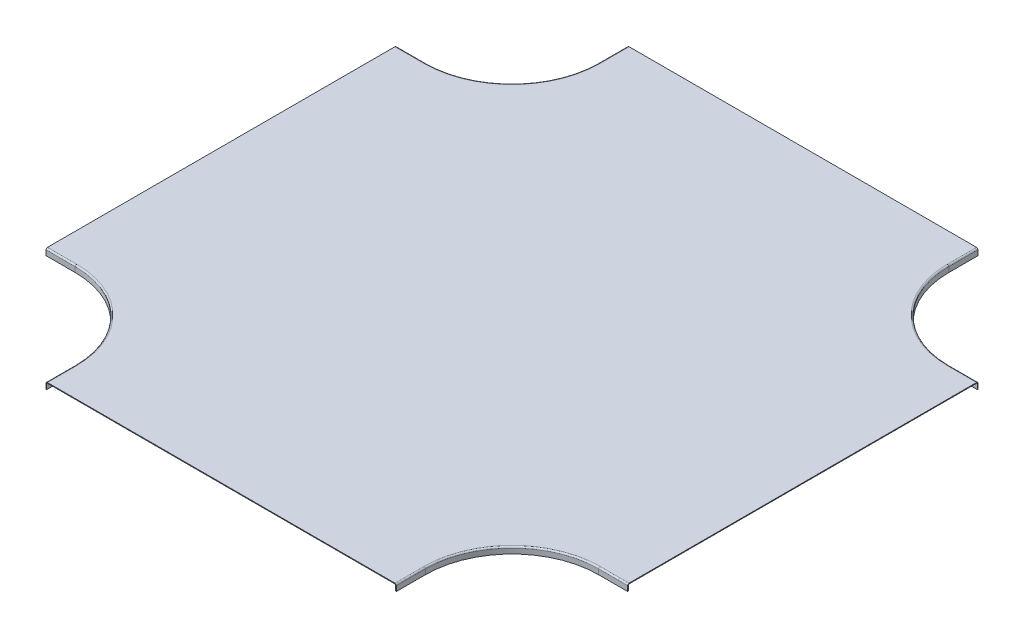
ISO-10303-21;
HEADER;
FILE_DESCRIPTION(('STEP AP214'),'2;1');
FILE_NAME('part.step','',(''),(''),'','','');
FILE_SCHEMA(('AUTOMOTIVE_DESIGN { 1 0 10303 214 1 1 1 1 }'));
ENDSEC;
DATA;
#1=APPLICATION_CONTEXT('core data for automotive mechanical design processes');
#2=APPLICATION_PROTOCOL_DEFINITION('international standard','automotive_design',2000,#1);
#3=PRODUCT_CONTEXT('',#1,'mechanical');
#4=PRODUCT('Part','Part','',(#3));
#5=PRODUCT_RELATED_PRODUCT_CATEGORY('part','',(#4));
#6=PRODUCT_DEFINITION_FORMATION('','',#4);
#7=PRODUCT_DEFINITION_CONTEXT('part definition',#1,'design');
#8=PRODUCT_DEFINITION('design','',#6,#7);
#9=PRODUCT_DEFINITION_SHAPE('','',#8);
#10=(LENGTH_UNIT() NAMED_UNIT(*) SI_UNIT(.MILLI.,.METRE.));
#11=(NAMED_UNIT(*) PLANE_ANGLE_UNIT() SI_UNIT($,.RADIAN.));
#12=(NAMED_UNIT(*) SI_UNIT($,.STERADIAN.) SOLID_ANGLE_UNIT());
#13=UNCERTAINTY_MEASURE_WITH_UNIT(LENGTH_MEASURE(1.E-05),#10,'distance_accuracy_value','');
#14=(GEOMETRIC_REPRESENTATION_CONTEXT(3) GLOBAL_UNCERTAINTY_ASSIGNED_CONTEXT((#13)) GLOBAL_UNIT_ASSIGNED_CONTEXT((#10,
#11,#12)) REPRESENTATION_CONTEXT('',''));
#15=CARTESIAN_POINT('',(0.,0.,0.));
#16=DIRECTION('',(0.,0.,1.));
#17=DIRECTION('',(1.,0.,0.));
#18=AXIS2_PLACEMENT_3D('',#15,#16,#17);
#19=CARTESIAN_POINT('',(-200.,1.21412,800.));
#20=DIRECTION('',(1.,0.,0.));
#21=DIRECTION('',(0.,0.,-1.));
#22=AXIS2_PLACEMENT_3D('',#19,#20,#21);
#23=PLANE('',#22);
#24=DIRECTION('',(0.,0.,1.));
#25=VECTOR('',#24,1.);
#26=CARTESIAN_POINT('',(-200.,0.,800.));
#27=LINE('',#26,#25);
#28=CARTESIAN_POINT('',(-200.,0.,201.27));
#29=VERTEX_POINT('',#28);
#30=CARTESIAN_POINT('',(-200.,0.,798.73));
#31=VERTEX_POINT('',#30);
#32=EDGE_CURVE('E727',#29,#31,#27,.T.);
#33=ORIENTED_EDGE('',*,*,#32,.T.);
#34=DIRECTION('',(0.,-1.,0.));
#35=VECTOR('',#34,1.);
#36=CARTESIAN_POINT('',(-200.,0.,798.73));
#37=LINE('',#36,#35);
#38=CARTESIAN_POINT('',(-200.,1.21412,798.73));
#39=VERTEX_POINT('',#38);
#40=EDGE_CURVE('E976',#39,#31,#37,.T.);
#41=ORIENTED_EDGE('',*,*,#40,.F.);
#42=DIRECTION('',(0.,0.,1.));
#43=VECTOR('',#42,1.);
#44=CARTESIAN_POINT('',(-200.,1.21412,800.));
#45=LINE('',#44,#43);
#46=CARTESIAN_POINT('',(-200.,1.21412,201.27));
#47=VERTEX_POINT('',#46);
#48=EDGE_CURVE('E725',#47,#39,#45,.T.);
#49=ORIENTED_EDGE('',*,*,#48,.F.);
#50=DIRECTION('',(0.,-1.,0.));
#51=VECTOR('',#50,1.);
#52=CARTESIAN_POINT('',(-200.,0.,201.27));
#53=LINE('',#52,#51);
#54=EDGE_CURVE('E862',#47,#29,#53,.T.);
#55=ORIENTED_EDGE('',*,*,#54,.T.);
#56=EDGE_LOOP('',(#33,#41,#49,#55));
#57=FACE_BOUND('',#56,.T.);
#58=ADVANCED_FACE('F380',(#57),#23,.F.);
#59=CARTESIAN_POINT('',(600.,1.21412,1000.));
#60=DIRECTION('',(0.,0.,-1.));
#61=DIRECTION('',(-1.,0.,0.));
#62=AXIS2_PLACEMENT_3D('',#59,#60,#61);
#63=PLANE('',#62);
#64=DIRECTION('',(1.,0.,0.));
#65=VECTOR('',#64,1.);
#66=CARTESIAN_POINT('',(600.,0.,1000.));
#67=LINE('',#66,#65);
#68=CARTESIAN_POINT('',(1.26999999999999,0.,1000.));
#69=VERTEX_POINT('',#68);
#70=CARTESIAN_POINT('',(598.73,0.,1000.));
#71=VERTEX_POINT('',#70);
#72=EDGE_CURVE('E723',#69,#71,#67,.T.);
#73=ORIENTED_EDGE('',*,*,#72,.T.);
#74=DIRECTION('',(0.,-1.,0.));
#75=VECTOR('',#74,1.);
#76=CARTESIAN_POINT('',(598.73,0.,1000.));
#77=LINE('',#76,#75);
#78=CARTESIAN_POINT('',(598.73,1.21412,1000.));
#79=VERTEX_POINT('',#78);
#80=EDGE_CURVE('E717',#79,#71,#77,.T.);
#81=ORIENTED_EDGE('',*,*,#80,.F.);
#82=DIRECTION('',(1.,0.,0.));
#83=VECTOR('',#82,1.);
#84=CARTESIAN_POINT('',(600.,1.21412,1000.));
#85=LINE('',#84,#83);
#86=CARTESIAN_POINT('',(1.26999999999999,1.21412,1000.));
#87=VERTEX_POINT('',#86);
#88=EDGE_CURVE('E734',#87,#79,#85,.T.);
#89=ORIENTED_EDGE('',*,*,#88,.F.);
#90=DIRECTION('',(0.,-1.,0.));
#91=VECTOR('',#90,1.);
#92=CARTESIAN_POINT('',(1.26999999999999,0.,1000.));
#93=LINE('',#92,#91);
#94=EDGE_CURVE('E978',#87,#69,#93,.T.);
#95=ORIENTED_EDGE('',*,*,#94,.T.);
#96=EDGE_LOOP('',(#73,#81,#89,#95));
#97=FACE_BOUND('',#96,.T.);
#98=ADVANCED_FACE('F1217',(#97),#63,.F.);
#99=CARTESIAN_POINT('',(800.,1.21412,200.));
#100=DIRECTION('',(-1.,0.,0.));
#101=DIRECTION('',(0.,0.,1.));
#102=AXIS2_PLACEMENT_3D('',#99,#100,#101);
#103=PLANE('',#102);
#104=DIRECTION('',(0.,0.,-1.));
#105=VECTOR('',#104,1.);
#106=CARTESIAN_POINT('',(800.,0.,200.));
#107=LINE('',#106,#105);
#108=CARTESIAN_POINT('',(800.,0.,798.73));
#109=VERTEX_POINT('',#108);
#110=CARTESIAN_POINT('',(800.,0.,201.27));
#111=VERTEX_POINT('',#110);
#112=EDGE_CURVE('E715',#109,#111,#107,.T.);
#113=ORIENTED_EDGE('',*,*,#112,.T.);
#114=DIRECTION('',(0.,-1.,0.));
#115=VECTOR('',#114,1.);
#116=CARTESIAN_POINT('',(800.,0.,201.27));
#117=LINE('',#116,#115);
#118=CARTESIAN_POINT('',(800.,1.21412,201.27));
#119=VERTEX_POINT('',#118);
#120=EDGE_CURVE('E744',#119,#111,#117,.T.);
#121=ORIENTED_EDGE('',*,*,#120,.F.);
#122=DIRECTION('',(0.,0.,-1.));
#123=VECTOR('',#122,1.);
#124=CARTESIAN_POINT('',(800.,1.21412,200.));
#125=LINE('',#124,#123);
#126=CARTESIAN_POINT('',(800.,1.21412,798.73));
#127=VERTEX_POINT('',#126);
#128=EDGE_CURVE('E388',#127,#119,#125,.T.);
#129=ORIENTED_EDGE('',*,*,#128,.F.);
#130=DIRECTION('',(0.,-1.,0.));
#131=VECTOR('',#130,1.);
#132=CARTESIAN_POINT('',(800.,0.,798.73));
#133=LINE('',#132,#131);
#134=EDGE_CURVE('E706',#127,#109,#133,.T.);
#135=ORIENTED_EDGE('',*,*,#134,.T.);
#136=EDGE_LOOP('',(#113,#121,#129,#135));
#137=FACE_BOUND('',#136,.T.);
#138=ADVANCED_FACE('F713',(#137),#103,.F.);
#139=CARTESIAN_POINT('',(0.,1.21412,0.));
#140=DIRECTION('',(0.,0.,1.));
#141=DIRECTION('',(1.,0.,0.));
#142=AXIS2_PLACEMENT_3D('',#139,#140,#141);
#143=PLANE('',#142);
#144=DIRECTION('',(-1.,0.,0.));
#145=VECTOR('',#144,1.);
#146=CARTESIAN_POINT('',(0.,0.,0.));
#147=LINE('',#146,#145);
#148=CARTESIAN_POINT('',(598.73,0.,0.));
#149=VERTEX_POINT('',#148);
#150=CARTESIAN_POINT('',(1.26999999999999,0.,0.));
#151=VERTEX_POINT('',#150);
#152=EDGE_CURVE('E383',#149,#151,#147,.T.);
#153=ORIENTED_EDGE('',*,*,#152,.T.);
#154=DIRECTION('',(0.,-1.,0.));
#155=VECTOR('',#154,1.);
#156=CARTESIAN_POINT('',(1.27,0.,0.));
#157=LINE('',#156,#155);
#158=CARTESIAN_POINT('',(1.27,1.21412,0.));
#159=VERTEX_POINT('',#158);
#160=EDGE_CURVE('E859',#159,#151,#157,.T.);
#161=ORIENTED_EDGE('',*,*,#160,.F.);
#162=DIRECTION('',(-1.,0.,0.));
#163=VECTOR('',#162,1.);
#164=CARTESIAN_POINT('',(0.,1.21412,0.));
#165=LINE('',#164,#163);
#166=CARTESIAN_POINT('',(598.73,1.21412,0.));
#167=VERTEX_POINT('',#166);
#168=EDGE_CURVE('E12',#167,#159,#165,.T.);
#169=ORIENTED_EDGE('',*,*,#168,.F.);
#170=DIRECTION('',(0.,-1.,0.));
#171=VECTOR('',#170,1.);
#172=CARTESIAN_POINT('',(598.73,0.,0.));
#173=LINE('',#172,#171);
#174=EDGE_CURVE('E747',#167,#149,#173,.T.);
#175=ORIENTED_EDGE('',*,*,#174,.T.);
#176=EDGE_LOOP('',(#153,#161,#169,#175));
#177=FACE_BOUND('',#176,.T.);
#178=ADVANCED_FACE('F1309',(#177),#143,.F.);
#179=CARTESIAN_POINT('',(750.,1.21412,50.));
#180=DIRECTION('',(0.,1.,0.));
#181=DIRECTION('',(0.,0.,1.));
#182=AXIS2_PLACEMENT_3D('',#179,#180,#181);
#183=PLANE('',#182);
#184=DIRECTION('',(-1.,0.,0.));
#185=VECTOR('',#184,1.);
#186=CARTESIAN_POINT('',(800.,1.21412,798.73));
#187=LINE('',#186,#185);
#188=CARTESIAN_POINT('',(750.,1.21412,798.73));
#189=VERTEX_POINT('',#188);
#190=EDGE_CURVE('E1111',#127,#189,#187,.T.);
#191=ORIENTED_EDGE('',*,*,#190,.F.);
#192=ORIENTED_EDGE('',*,*,#128,.T.);
#193=DIRECTION('',(1.,0.,0.));
#194=VECTOR('',#193,1.);
#195=CARTESIAN_POINT('',(750.,1.21412,201.27));
#196=LINE('',#195,#194);
#197=CARTESIAN_POINT('',(750.,1.21412,201.27));
#198=VERTEX_POINT('',#197);
#199=EDGE_CURVE('E765',#198,#119,#196,.T.);
#200=ORIENTED_EDGE('',*,*,#199,.F.);
#201=CARTESIAN_POINT('',(750.,1.21412,50.));
#202=DIRECTION('',(0.,1.,0.));
#203=DIRECTION('',(0.,0.,1.));
#204=AXIS2_PLACEMENT_3D('',#201,#202,#203);
#205=CIRCLE('',#204,151.27);
#206=CARTESIAN_POINT('',(598.73,1.21412,50.));
#207=VERTEX_POINT('',#206);
#208=EDGE_CURVE('E769',#207,#198,#205,.T.);
#209=ORIENTED_EDGE('',*,*,#208,.F.);
#210=DIRECTION('',(0.,0.,1.));
#211=VECTOR('',#210,1.);
#212=CARTESIAN_POINT('',(598.73,1.21412,0.));
#213=LINE('',#212,#211);
#214=EDGE_CURVE('E774',#167,#207,#213,.T.);
#215=ORIENTED_EDGE('',*,*,#214,.F.);
#216=ORIENTED_EDGE('',*,*,#168,.T.);
#217=DIRECTION('',(0.,0.,-1.));
#218=VECTOR('',#217,1.);
#219=CARTESIAN_POINT('',(1.27,1.21412,50.));
#220=LINE('',#219,#218);
#221=CARTESIAN_POINT('',(1.27000000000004,1.21412,50.));
#222=VERTEX_POINT('',#221);
#223=EDGE_CURVE('E880',#222,#159,#220,.T.);
#224=ORIENTED_EDGE('',*,*,#223,.F.);
#225=CARTESIAN_POINT('',(-150.,1.21412,50.));
#226=DIRECTION('',(0.,1.,0.));
#227=DIRECTION('',(0.,0.,1.));
#228=AXIS2_PLACEMENT_3D('',#225,#226,#227);
#229=CIRCLE('',#228,151.27);
#230=CARTESIAN_POINT('',(-150.,1.21412,201.27));
#231=VERTEX_POINT('',#230);
#232=EDGE_CURVE('E883',#231,#222,#229,.T.);
#233=ORIENTED_EDGE('',*,*,#232,.F.);
#234=DIRECTION('',(1.,0.,0.));
#235=VECTOR('',#234,1.);
#236=CARTESIAN_POINT('',(-200.,1.21412,201.27));
#237=LINE('',#236,#235);
#238=EDGE_CURVE('E888',#47,#231,#237,.T.);
#239=ORIENTED_EDGE('',*,*,#238,.F.);
#240=ORIENTED_EDGE('',*,*,#48,.T.);
#241=DIRECTION('',(-1.,0.,0.));
#242=VECTOR('',#241,1.);
#243=CARTESIAN_POINT('',(-150.,1.21412,798.73));
#244=LINE('',#243,#242);
#245=CARTESIAN_POINT('',(-150.,1.21412,798.73));
#246=VERTEX_POINT('',#245);
#247=EDGE_CURVE('E996',#246,#39,#244,.T.);
#248=ORIENTED_EDGE('',*,*,#247,.F.);
#249=CARTESIAN_POINT('',(-150.,1.21412,950.));
#250=DIRECTION('',(0.,1.,0.));
#251=DIRECTION('',(0.,0.,1.));
#252=AXIS2_PLACEMENT_3D('',#249,#250,#251);
#253=CIRCLE('',#252,151.27);
#254=CARTESIAN_POINT('',(1.26999999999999,1.21412,950.));
#255=VERTEX_POINT('',#254);
#256=EDGE_CURVE('E999',#255,#246,#253,.T.);
#257=ORIENTED_EDGE('',*,*,#256,.F.);
#258=DIRECTION('',(0.,0.,-1.));
#259=VECTOR('',#258,1.);
#260=CARTESIAN_POINT('',(1.26999999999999,1.21412,1000.));
#261=LINE('',#260,#259);
#262=EDGE_CURVE('E1004',#87,#255,#261,.T.);
#263=ORIENTED_EDGE('',*,*,#262,.F.);
#264=ORIENTED_EDGE('',*,*,#88,.T.);
#265=DIRECTION('',(0.,0.,1.));
#266=VECTOR('',#265,1.);
#267=CARTESIAN_POINT('',(598.73,1.21412,950.));
#268=LINE('',#267,#266);
#269=CARTESIAN_POINT('',(598.73,1.21412,950.000000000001));
#270=VERTEX_POINT('',#269);
#271=EDGE_CURVE('E1103',#270,#79,#268,.T.);
#272=ORIENTED_EDGE('',*,*,#271,.F.);
#273=CARTESIAN_POINT('',(750.,1.21412,950.));
#274=DIRECTION('',(0.,1.,0.));
#275=DIRECTION('',(0.,0.,1.));
#276=AXIS2_PLACEMENT_3D('',#273,#274,#275);
#277=CIRCLE('',#276,151.27);
#278=EDGE_CURVE('E1106',#189,#270,#277,.T.);
#279=ORIENTED_EDGE('',*,*,#278,.F.);
#280=EDGE_LOOP('',(#191,#192,#200,#209,#215,#216,#224,#233,#239,#240,#248,#257,#263,#264,#272,#279));
#281=FACE_BOUND('',#280,.T.);
#282=ADVANCED_FACE('F1211',(#281),#183,.T.);
#283=CARTESIAN_POINT('',(750.,0.,50.));
#284=DIRECTION('',(0.,1.,0.));
#285=DIRECTION('',(0.,0.,1.));
#286=AXIS2_PLACEMENT_3D('',#283,#284,#285);
#287=PLANE('',#286);
#288=ORIENTED_EDGE('',*,*,#112,.F.);
#289=DIRECTION('',(-1.,0.,0.));
#290=VECTOR('',#289,1.);
#291=CARTESIAN_POINT('',(800.,0.,798.73));
#292=LINE('',#291,#290);
#293=CARTESIAN_POINT('',(750.,0.,798.73));
#294=VERTEX_POINT('',#293);
#295=EDGE_CURVE('E689',#109,#294,#292,.T.);
#296=ORIENTED_EDGE('',*,*,#295,.T.);
#297=CARTESIAN_POINT('',(750.,0.,950.));
#298=DIRECTION('',(0.,1.,0.));
#299=DIRECTION('',(0.,0.,-1.));
#300=AXIS2_PLACEMENT_3D('',#297,#298,#299);
#301=CIRCLE('',#300,151.27);
#302=CARTESIAN_POINT('',(598.73,0.,950.000000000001));
#303=VERTEX_POINT('',#302);
#304=EDGE_CURVE('E1159',#294,#303,#301,.T.);
#305=ORIENTED_EDGE('',*,*,#304,.T.);
#306=DIRECTION('',(0.,0.,1.));
#307=VECTOR('',#306,1.);
#308=CARTESIAN_POINT('',(598.73,0.,950.));
#309=LINE('',#308,#307);
#310=EDGE_CURVE('E1151',#303,#71,#309,.T.);
#311=ORIENTED_EDGE('',*,*,#310,.T.);
#312=ORIENTED_EDGE('',*,*,#72,.F.);
#313=DIRECTION('',(0.,0.,-1.));
#314=VECTOR('',#313,1.);
#315=CARTESIAN_POINT('',(1.26999999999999,0.,1000.));
#316=LINE('',#315,#314);
#317=CARTESIAN_POINT('',(1.26999999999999,0.,950.));
#318=VERTEX_POINT('',#317);
#319=EDGE_CURVE('E1063',#69,#318,#316,.T.);
#320=ORIENTED_EDGE('',*,*,#319,.T.);
#321=CARTESIAN_POINT('',(-150.,0.,950.));
#322=DIRECTION('',(0.,1.,0.));
#323=DIRECTION('',(1.,0.,0.));
#324=AXIS2_PLACEMENT_3D('',#321,#322,#323);
#325=CIRCLE('',#324,151.27);
#326=CARTESIAN_POINT('',(-150.,0.,798.73));
#327=VERTEX_POINT('',#326);
#328=EDGE_CURVE('E1055',#318,#327,#325,.T.);
#329=ORIENTED_EDGE('',*,*,#328,.T.);
#330=DIRECTION('',(-1.,0.,0.));
#331=VECTOR('',#330,1.);
#332=CARTESIAN_POINT('',(-150.,0.,798.73));
#333=LINE('',#332,#331);
#334=EDGE_CURVE('E1047',#327,#31,#333,.T.);
#335=ORIENTED_EDGE('',*,*,#334,.T.);
#336=ORIENTED_EDGE('',*,*,#32,.F.);
#337=DIRECTION('',(1.,0.,0.));
#338=VECTOR('',#337,1.);
#339=CARTESIAN_POINT('',(-200.,0.,201.27));
#340=LINE('',#339,#338);
#341=CARTESIAN_POINT('',(-150.,0.,201.27));
#342=VERTEX_POINT('',#341);
#343=EDGE_CURVE('E947',#29,#342,#340,.T.);
#344=ORIENTED_EDGE('',*,*,#343,.T.);
#345=CARTESIAN_POINT('',(-150.,0.,50.));
#346=DIRECTION('',(0.,1.,0.));
#347=DIRECTION('',(0.,0.,1.));
#348=AXIS2_PLACEMENT_3D('',#345,#346,#347);
#349=CIRCLE('',#348,151.27);
#350=CARTESIAN_POINT('',(1.27000000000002,0.,50.));
#351=VERTEX_POINT('',#350);
#352=EDGE_CURVE('E939',#342,#351,#349,.T.);
#353=ORIENTED_EDGE('',*,*,#352,.T.);
#354=DIRECTION('',(0.,0.,-1.));
#355=VECTOR('',#354,1.);
#356=CARTESIAN_POINT('',(1.27,0.,50.));
#357=LINE('',#356,#355);
#358=EDGE_CURVE('E931',#351,#151,#357,.T.);
#359=ORIENTED_EDGE('',*,*,#358,.T.);
#360=ORIENTED_EDGE('',*,*,#152,.F.);
#361=DIRECTION('',(0.,0.,1.));
#362=VECTOR('',#361,1.);
#363=CARTESIAN_POINT('',(598.73,0.,0.));
#364=LINE('',#363,#362);
#365=CARTESIAN_POINT('',(598.73,0.,50.));
#366=VERTEX_POINT('',#365);
#367=EDGE_CURVE('E832',#149,#366,#364,.T.);
#368=ORIENTED_EDGE('',*,*,#367,.T.);
#369=CARTESIAN_POINT('',(750.,0.,50.));
#370=DIRECTION('',(0.,1.,0.));
#371=DIRECTION('',(-1.,0.,0.));
#372=AXIS2_PLACEMENT_3D('',#369,#370,#371);
#373=CIRCLE('',#372,151.27);
#374=CARTESIAN_POINT('',(750.,0.,201.27));
#375=VERTEX_POINT('',#374);
#376=EDGE_CURVE('E824',#366,#375,#373,.T.);
#377=ORIENTED_EDGE('',*,*,#376,.T.);
#378=DIRECTION('',(1.,0.,0.));
#379=VECTOR('',#378,1.);
#380=CARTESIAN_POINT('',(750.,0.,201.27));
#381=LINE('',#380,#379);
#382=EDGE_CURVE('E722',#375,#111,#381,.T.);
#383=ORIENTED_EDGE('',*,*,#382,.T.);
#384=EDGE_LOOP('',(#288,#296,#305,#311,#312,#320,#329,#335,#336,#344,#353,#359,#360,#368,#377,#383));
#385=FACE_BOUND('',#384,.T.);
#386=ADVANCED_FACE('F720',(#385),#287,.F.);
#387=CARTESIAN_POINT('',(800.,-1.27,201.27));
#388=DIRECTION('',(-1.,0.,0.));
#389=DIRECTION('',(0.,0.,1.));
#390=AXIS2_PLACEMENT_3D('',#387,#388,#389);
#391=PLANE('',#390);
#392=DIRECTION('',(0.,0.,1.));
#393=VECTOR('',#392,1.);
#394=CARTESIAN_POINT('',(800.,-1.27,200.));
#395=LINE('',#394,#393);
#396=CARTESIAN_POINT('',(800.,-1.27000000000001,198.78588));
#397=VERTEX_POINT('',#396);
#398=CARTESIAN_POINT('',(800.,-1.27,200.));
#399=VERTEX_POINT('',#398);
#400=EDGE_CURVE('E731',#397,#399,#395,.T.);
#401=ORIENTED_EDGE('',*,*,#400,.F.);
#402=CARTESIAN_POINT('',(800.,-1.27,201.27));
#403=DIRECTION('',(1.,0.,0.));
#404=DIRECTION('',(0.,0.,-1.));
#405=AXIS2_PLACEMENT_3D('',#402,#403,#404);
#406=CIRCLE('',#405,2.48412);
#407=EDGE_CURVE('E762',#119,#397,#406,.F.);
#408=ORIENTED_EDGE('',*,*,#407,.F.);
#409=ORIENTED_EDGE('',*,*,#120,.T.);
#410=CARTESIAN_POINT('',(800.,-1.27,201.27));
#411=DIRECTION('',(1.,0.,0.));
#412=DIRECTION('',(0.,0.,-1.));
#413=AXIS2_PLACEMENT_3D('',#410,#411,#412);
#414=CIRCLE('',#413,1.27);
#415=EDGE_CURVE('E834',#111,#399,#414,.F.);
#416=ORIENTED_EDGE('',*,*,#415,.T.);
#417=EDGE_LOOP('',(#401,#408,#409,#416));
#418=FACE_BOUND('',#417,.T.);
#419=ADVANCED_FACE('F1348',(#418),#391,.F.);
#420=CARTESIAN_POINT('',(598.73,-1.27,0.));
#421=DIRECTION('',(0.,0.,-1.));
#422=DIRECTION('',(-1.,0.,0.));
#423=AXIS2_PLACEMENT_3D('',#420,#421,#422);
#424=PLANE('',#423);
#425=ORIENTED_EDGE('',*,*,#174,.F.);
#426=CARTESIAN_POINT('',(598.73,-1.27,0.));
#427=DIRECTION('',(0.,0.,1.));
#428=DIRECTION('',(1.,0.,0.));
#429=AXIS2_PLACEMENT_3D('',#426,#427,#428);
#430=CIRCLE('',#429,2.48412);
#431=CARTESIAN_POINT('',(601.21412,-1.27000000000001,0.));
#432=VERTEX_POINT('',#431);
#433=EDGE_CURVE('E779',#167,#432,#430,.F.);
#434=ORIENTED_EDGE('',*,*,#433,.T.);
#435=DIRECTION('',(-1.,0.,0.));
#436=VECTOR('',#435,1.);
#437=CARTESIAN_POINT('',(600.,-1.27,0.));
#438=LINE('',#437,#436);
#439=CARTESIAN_POINT('',(600.,-1.27,0.));
#440=VERTEX_POINT('',#439);
#441=EDGE_CURVE('E750',#432,#440,#438,.T.);
#442=ORIENTED_EDGE('',*,*,#441,.T.);
#443=CARTESIAN_POINT('',(598.73,-1.27,0.));
#444=DIRECTION('',(0.,0.,1.));
#445=DIRECTION('',(1.,0.,0.));
#446=AXIS2_PLACEMENT_3D('',#443,#444,#445);
#447=CIRCLE('',#446,1.27);
#448=EDGE_CURVE('E793',#149,#440,#447,.F.);
#449=ORIENTED_EDGE('',*,*,#448,.F.);
#450=EDGE_LOOP('',(#425,#434,#442,#449));
#451=FACE_BOUND('',#450,.T.);
#452=ADVANCED_FACE('F1314',(#451),#424,.T.);
#453=CARTESIAN_POINT('',(600.,0.,0.));
#454=DIRECTION('',(0.,0.,-1.));
#455=DIRECTION('',(0.,-1.,0.));
#456=AXIS2_PLACEMENT_3D('',#453,#454,#455);
#457=PLANE('',#456);
#458=ORIENTED_EDGE('',*,*,#441,.F.);
#459=DIRECTION('',(0.,-1.,0.));
#460=VECTOR('',#459,1.);
#461=CARTESIAN_POINT('',(601.21412,0.,0.));
#462=LINE('',#461,#460);
#463=CARTESIAN_POINT('',(601.21412,-10.,0.));
#464=VERTEX_POINT('',#463);
#465=EDGE_CURVE('E778',#432,#464,#462,.T.);
#466=ORIENTED_EDGE('',*,*,#465,.T.);
#467=DIRECTION('',(-1.,0.,0.));
#468=VECTOR('',#467,1.);
#469=CARTESIAN_POINT('',(600.,-10.,0.));
#470=LINE('',#469,#468);
#471=CARTESIAN_POINT('',(600.,-10.,0.));
#472=VERTEX_POINT('',#471);
#473=EDGE_CURVE('E752',#464,#472,#470,.T.);
#474=ORIENTED_EDGE('',*,*,#473,.T.);
#475=DIRECTION('',(0.,-1.,0.));
#476=VECTOR('',#475,1.);
#477=CARTESIAN_POINT('',(600.,0.,0.));
#478=LINE('',#477,#476);
#479=EDGE_CURVE('E829',#440,#472,#478,.T.);
#480=ORIENTED_EDGE('',*,*,#479,.F.);
#481=EDGE_LOOP('',(#458,#466,#474,#480));
#482=FACE_BOUND('',#481,.T.);
#483=ADVANCED_FACE('F1335',(#482),#457,.T.);
#484=CARTESIAN_POINT('',(600.,-10.,0.));
#485=DIRECTION('',(0.,-1.,0.));
#486=DIRECTION('',(0.,0.,1.));
#487=AXIS2_PLACEMENT_3D('',#484,#485,#486);
#488=PLANE('',#487);
#489=ORIENTED_EDGE('',*,*,#473,.F.);
#490=DIRECTION('',(0.,0.,1.));
#491=VECTOR('',#490,1.);
#492=CARTESIAN_POINT('',(601.21412,-10.,0.));
#493=LINE('',#492,#491);
#494=CARTESIAN_POINT('',(601.21412,-10.,50.));
#495=VERTEX_POINT('',#494);
#496=EDGE_CURVE('E773',#464,#495,#493,.T.);
#497=ORIENTED_EDGE('',*,*,#496,.T.);
#498=DIRECTION('',(-1.,0.,0.));
#499=VECTOR('',#498,1.);
#500=CARTESIAN_POINT('',(600.,-10.,50.));
#501=LINE('',#500,#499);
#502=CARTESIAN_POINT('',(600.,-10.,50.));
#503=VERTEX_POINT('',#502);
#504=EDGE_CURVE('E754',#495,#503,#501,.T.);
#505=ORIENTED_EDGE('',*,*,#504,.T.);
#506=DIRECTION('',(0.,0.,1.));
#507=VECTOR('',#506,1.);
#508=CARTESIAN_POINT('',(600.,-10.,0.));
#509=LINE('',#508,#507);
#510=EDGE_CURVE('E821',#472,#503,#509,.T.);
#511=ORIENTED_EDGE('',*,*,#510,.F.);
#512=EDGE_LOOP('',(#489,#497,#505,#511));
#513=FACE_BOUND('',#512,.T.);
#514=ADVANCED_FACE('F1367',(#513),#488,.T.);
#515=CARTESIAN_POINT('',(750.,-10.,50.));
#516=DIRECTION('',(0.,-1.,0.));
#517=DIRECTION('',(0.,0.,-1.));
#518=AXIS2_PLACEMENT_3D('',#515,#516,#517);
#519=PLANE('',#518);
#520=ORIENTED_EDGE('',*,*,#504,.F.);
#521=CARTESIAN_POINT('',(750.,-10.,50.));
#522=DIRECTION('',(0.,1.,0.));
#523=DIRECTION('',(0.,0.,1.));
#524=AXIS2_PLACEMENT_3D('',#521,#522,#523);
#525=CIRCLE('',#524,148.78588);
#526=CARTESIAN_POINT('',(750.,-10.,198.78588));
#527=VERTEX_POINT('',#526);
#528=EDGE_CURVE('E768',#495,#527,#525,.T.);
#529=ORIENTED_EDGE('',*,*,#528,.T.);
#530=DIRECTION('',(0.,0.,1.));
#531=VECTOR('',#530,1.);
#532=CARTESIAN_POINT('',(750.,-10.,200.));
#533=LINE('',#532,#531);
#534=CARTESIAN_POINT('',(750.,-10.,200.));
#535=VERTEX_POINT('',#534);
#536=EDGE_CURVE('E741',#527,#535,#533,.T.);
#537=ORIENTED_EDGE('',*,*,#536,.T.);
#538=CARTESIAN_POINT('',(750.,-10.,50.));
#539=DIRECTION('',(0.,1.,0.));
#540=DIRECTION('',(-1.,0.,0.));
#541=AXIS2_PLACEMENT_3D('',#538,#539,#540);
#542=CIRCLE('',#541,150.);
#543=EDGE_CURVE('E814',#503,#535,#542,.T.);
#544=ORIENTED_EDGE('',*,*,#543,.F.);
#545=EDGE_LOOP('',(#520,#529,#537,#544));
#546=FACE_BOUND('',#545,.T.);
#547=ADVANCED_FACE('F1364',(#546),#519,.T.);
#548=CARTESIAN_POINT('',(750.,-10.,200.));
#549=DIRECTION('',(0.,-1.,0.));
#550=DIRECTION('',(1.,0.,0.));
#551=AXIS2_PLACEMENT_3D('',#548,#549,#550);
#552=PLANE('',#551);
#553=ORIENTED_EDGE('',*,*,#536,.F.);
#554=DIRECTION('',(1.,0.,0.));
#555=VECTOR('',#554,1.);
#556=CARTESIAN_POINT('',(750.,-10.,198.78588));
#557=LINE('',#556,#555);
#558=CARTESIAN_POINT('',(800.,-10.,198.78588));
#559=VERTEX_POINT('',#558);
#560=EDGE_CURVE('E760',#527,#559,#557,.T.);
#561=ORIENTED_EDGE('',*,*,#560,.T.);
#562=DIRECTION('',(0.,0.,1.));
#563=VECTOR('',#562,1.);
#564=CARTESIAN_POINT('',(800.,-10.,200.));
#565=LINE('',#564,#563);
#566=CARTESIAN_POINT('',(800.,-10.,200.));
#567=VERTEX_POINT('',#566);
#568=EDGE_CURVE('E739',#559,#567,#565,.T.);
#569=ORIENTED_EDGE('',*,*,#568,.T.);
#570=DIRECTION('',(1.,0.,0.));
#571=VECTOR('',#570,1.);
#572=CARTESIAN_POINT('',(750.,-10.,200.));
#573=LINE('',#572,#571);
#574=EDGE_CURVE('E742',#535,#567,#573,.T.);
#575=ORIENTED_EDGE('',*,*,#574,.F.);
#576=EDGE_LOOP('',(#553,#561,#569,#575));
#577=FACE_BOUND('',#576,.T.);
#578=ADVANCED_FACE('F1360',(#577),#552,.T.);
#579=CARTESIAN_POINT('',(800.,0.,200.));
#580=DIRECTION('',(-1.,0.,0.));
#581=DIRECTION('',(0.,-1.,0.));
#582=AXIS2_PLACEMENT_3D('',#579,#580,#581);
#583=PLANE('',#582);
#584=DIRECTION('',(0.,-1.,0.));
#585=VECTOR('',#584,1.);
#586=CARTESIAN_POINT('',(800.,0.,198.78588));
#587=LINE('',#586,#585);
#588=EDGE_CURVE('E757',#397,#559,#587,.T.);
#589=ORIENTED_EDGE('',*,*,#588,.F.);
#590=ORIENTED_EDGE('',*,*,#400,.T.);
#591=DIRECTION('',(0.,-1.,0.));
#592=VECTOR('',#591,1.);
#593=CARTESIAN_POINT('',(800.,0.,200.));
#594=LINE('',#593,#592);
#595=EDGE_CURVE('E810',#399,#567,#594,.T.);
#596=ORIENTED_EDGE('',*,*,#595,.T.);
#597=ORIENTED_EDGE('',*,*,#568,.F.);
#598=EDGE_LOOP('',(#589,#590,#596,#597));
#599=FACE_BOUND('',#598,.T.);
#600=ADVANCED_FACE('F1354',(#599),#583,.F.);
#601=CARTESIAN_POINT('',(750.,0.,200.));
#602=DIRECTION('',(0.,0.,1.));
#603=DIRECTION('',(0.,-1.,0.));
#604=AXIS2_PLACEMENT_3D('',#601,#602,#603);
#605=PLANE('',#604);
#606=ORIENTED_EDGE('',*,*,#574,.T.);
#607=ORIENTED_EDGE('',*,*,#595,.F.);
#608=DIRECTION('',(1.,0.,0.));
#609=VECTOR('',#608,1.);
#610=CARTESIAN_POINT('',(750.,-1.27,200.));
#611=LINE('',#610,#609);
#612=CARTESIAN_POINT('',(750.,-1.27,200.));
#613=VERTEX_POINT('',#612);
#614=EDGE_CURVE('E813',#613,#399,#611,.T.);
#615=ORIENTED_EDGE('',*,*,#614,.F.);
#616=DIRECTION('',(0.,-1.,0.));
#617=VECTOR('',#616,1.);
#618=CARTESIAN_POINT('',(750.,0.,200.));
#619=LINE('',#618,#617);
#620=EDGE_CURVE('E817',#613,#535,#619,.T.);
#621=ORIENTED_EDGE('',*,*,#620,.T.);
#622=EDGE_LOOP('',(#606,#607,#615,#621));
#623=FACE_BOUND('',#622,.T.);
#624=ADVANCED_FACE('F1375',(#623),#605,.T.);
#625=CARTESIAN_POINT('',(750.,-1.27,201.27));
#626=DIRECTION('',(1.,0.,0.));
#627=DIRECTION('',(0.,0.,-1.));
#628=AXIS2_PLACEMENT_3D('',#625,#626,#627);
#629=CYLINDRICAL_SURFACE('',#628,1.27);
#630=ORIENTED_EDGE('',*,*,#614,.T.);
#631=ORIENTED_EDGE('',*,*,#415,.F.);
#632=ORIENTED_EDGE('',*,*,#382,.F.);
#633=CARTESIAN_POINT('',(750.,-1.27,201.27));
#634=DIRECTION('',(1.,0.,0.));
#635=DIRECTION('',(0.,0.,-1.));
#636=AXIS2_PLACEMENT_3D('',#633,#634,#635);
#637=CIRCLE('',#636,1.27);
#638=EDGE_CURVE('E840',#375,#613,#637,.F.);
#639=ORIENTED_EDGE('',*,*,#638,.T.);
#640=EDGE_LOOP('',(#630,#631,#632,#639));
#641=FACE_BOUND('',#640,.T.);
#642=ADVANCED_FACE('F1345',(#641),#629,.F.);
#643=CARTESIAN_POINT('',(750.,0.,50.));
#644=DIRECTION('',(0.,1.,0.));
#645=DIRECTION('',(0.,0.,1.));
#646=AXIS2_PLACEMENT_3D('',#643,#644,#645);
#647=CYLINDRICAL_SURFACE('',#646,150.);
#648=ORIENTED_EDGE('',*,*,#543,.T.);
#649=ORIENTED_EDGE('',*,*,#620,.F.);
#650=CARTESIAN_POINT('',(750.,-1.27,50.));
#651=DIRECTION('',(0.,1.,0.));
#652=DIRECTION('',(-1.,0.,0.));
#653=AXIS2_PLACEMENT_3D('',#650,#651,#652);
#654=CIRCLE('',#653,150.);
#655=CARTESIAN_POINT('',(600.,-1.27,50.));
#656=VERTEX_POINT('',#655);
#657=EDGE_CURVE('E820',#656,#613,#654,.T.);
#658=ORIENTED_EDGE('',*,*,#657,.F.);
#659=DIRECTION('',(0.,-1.,0.));
#660=VECTOR('',#659,1.);
#661=CARTESIAN_POINT('',(600.,0.,50.));
#662=LINE('',#661,#660);
#663=EDGE_CURVE('E825',#656,#503,#662,.T.);
#664=ORIENTED_EDGE('',*,*,#663,.T.);
#665=EDGE_LOOP('',(#648,#649,#658,#664));
#666=FACE_BOUND('',#665,.T.);
#667=ADVANCED_FACE('F1372',(#666),#647,.T.);
#668=CARTESIAN_POINT('',(750.,-1.27,50.));
#669=DIRECTION('',(0.,1.,0.));
#670=DIRECTION('',(0.,0.,1.));
#671=AXIS2_PLACEMENT_3D('',#668,#669,#670);
#672=TOROIDAL_SURFACE('',#671,151.27,1.27);
#673=ORIENTED_EDGE('',*,*,#657,.T.);
#674=ORIENTED_EDGE('',*,*,#638,.F.);
#675=ORIENTED_EDGE('',*,*,#376,.F.);
#676=CARTESIAN_POINT('',(598.73,-1.27,50.));
#677=DIRECTION('',(0.,0.,1.));
#678=DIRECTION('',(1.,0.,0.));
#679=AXIS2_PLACEMENT_3D('',#676,#677,#678);
#680=CIRCLE('',#679,1.27);
#681=EDGE_CURVE('E847',#366,#656,#680,.F.);
#682=ORIENTED_EDGE('',*,*,#681,.T.);
#683=EDGE_LOOP('',(#673,#674,#675,#682));
#684=FACE_BOUND('',#683,.T.);
#685=ADVANCED_FACE('F1342',(#684),#672,.F.);
#686=CARTESIAN_POINT('',(600.,0.,0.));
#687=DIRECTION('',(-1.,0.,0.));
#688=DIRECTION('',(0.,-1.,0.));
#689=AXIS2_PLACEMENT_3D('',#686,#687,#688);
#690=PLANE('',#689);
#691=ORIENTED_EDGE('',*,*,#510,.T.);
#692=ORIENTED_EDGE('',*,*,#663,.F.);
#693=DIRECTION('',(0.,0.,1.));
#694=VECTOR('',#693,1.);
#695=CARTESIAN_POINT('',(600.,-1.27,0.));
#696=LINE('',#695,#694);
#697=EDGE_CURVE('E828',#440,#656,#696,.T.);
#698=ORIENTED_EDGE('',*,*,#697,.F.);
#699=ORIENTED_EDGE('',*,*,#479,.T.);
#700=EDGE_LOOP('',(#691,#692,#698,#699));
#701=FACE_BOUND('',#700,.T.);
#702=ADVANCED_FACE('F1370',(#701),#690,.T.);
#703=CARTESIAN_POINT('',(598.73,-1.27,0.));
#704=DIRECTION('',(0.,0.,1.));
#705=DIRECTION('',(1.,0.,0.));
#706=AXIS2_PLACEMENT_3D('',#703,#704,#705);
#707=CYLINDRICAL_SURFACE('',#706,1.27);
#708=ORIENTED_EDGE('',*,*,#697,.T.);
#709=ORIENTED_EDGE('',*,*,#681,.F.);
#710=ORIENTED_EDGE('',*,*,#367,.F.);
#711=ORIENTED_EDGE('',*,*,#448,.T.);
#712=EDGE_LOOP('',(#708,#709,#710,#711));
#713=FACE_BOUND('',#712,.T.);
#714=ADVANCED_FACE('F1339',(#713),#707,.F.);
#715=CARTESIAN_POINT('',(750.,0.,198.78588));
#716=DIRECTION('',(0.,0.,1.));
#717=DIRECTION('',(0.,-1.,0.));
#718=AXIS2_PLACEMENT_3D('',#715,#716,#717);
#719=PLANE('',#718);
#720=ORIENTED_EDGE('',*,*,#560,.F.);
#721=DIRECTION('',(0.,-1.,0.));
#722=VECTOR('',#721,1.);
#723=CARTESIAN_POINT('',(750.,0.,198.78588));
#724=LINE('',#723,#722);
#725=CARTESIAN_POINT('',(750.,-1.27000000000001,198.78588));
#726=VERTEX_POINT('',#725);
#727=EDGE_CURVE('E790',#726,#527,#724,.T.);
#728=ORIENTED_EDGE('',*,*,#727,.F.);
#729=DIRECTION('',(1.,0.,0.));
#730=VECTOR('',#729,1.);
#731=CARTESIAN_POINT('',(750.,-1.27000000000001,198.78588));
#732=LINE('',#731,#730);
#733=EDGE_CURVE('E761',#726,#397,#732,.T.);
#734=ORIENTED_EDGE('',*,*,#733,.T.);
#735=ORIENTED_EDGE('',*,*,#588,.T.);
#736=EDGE_LOOP('',(#720,#728,#734,#735));
#737=FACE_BOUND('',#736,.T.);
#738=ADVANCED_FACE('F1358',(#737),#719,.F.);
#739=CARTESIAN_POINT('',(750.,-1.27,201.27));
#740=DIRECTION('',(1.,0.,0.));
#741=DIRECTION('',(0.,0.,-1.));
#742=AXIS2_PLACEMENT_3D('',#739,#740,#741);
#743=CYLINDRICAL_SURFACE('',#742,2.48412);
#744=ORIENTED_EDGE('',*,*,#733,.F.);
#745=CARTESIAN_POINT('',(750.,-1.27,201.27));
#746=DIRECTION('',(1.,0.,0.));
#747=DIRECTION('',(0.,0.,-1.));
#748=AXIS2_PLACEMENT_3D('',#745,#746,#747);
#749=CIRCLE('',#748,2.48412);
#750=EDGE_CURVE('E772',#198,#726,#749,.F.);
#751=ORIENTED_EDGE('',*,*,#750,.F.);
#752=ORIENTED_EDGE('',*,*,#199,.T.);
#753=ORIENTED_EDGE('',*,*,#407,.T.);
#754=EDGE_LOOP('',(#744,#751,#752,#753));
#755=FACE_BOUND('',#754,.T.);
#756=ADVANCED_FACE('F1351',(#755),#743,.T.);
#757=CARTESIAN_POINT('',(750.,0.,50.));
#758=DIRECTION('',(0.,1.,0.));
#759=DIRECTION('',(0.,0.,1.));
#760=AXIS2_PLACEMENT_3D('',#757,#758,#759);
#761=CYLINDRICAL_SURFACE('',#760,148.78588);
#762=ORIENTED_EDGE('',*,*,#528,.F.);
#763=DIRECTION('',(0.,1.,0.));
#764=VECTOR('',#763,1.);
#765=CARTESIAN_POINT('',(601.21412,0.,50.));
#766=LINE('',#765,#764);
#767=CARTESIAN_POINT('',(601.21412,-1.27,50.));
#768=VERTEX_POINT('',#767);
#769=EDGE_CURVE('E787',#768,#495,#766,.F.);
#770=ORIENTED_EDGE('',*,*,#769,.F.);
#771=CARTESIAN_POINT('',(750.,-1.27000000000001,50.));
#772=DIRECTION('',(0.,1.,0.));
#773=DIRECTION('',(0.,0.,1.));
#774=AXIS2_PLACEMENT_3D('',#771,#772,#773);
#775=CIRCLE('',#774,148.78588);
#776=EDGE_CURVE('E800',#768,#726,#775,.T.);
#777=ORIENTED_EDGE('',*,*,#776,.T.);
#778=ORIENTED_EDGE('',*,*,#727,.T.);
#779=EDGE_LOOP('',(#762,#770,#777,#778));
#780=FACE_BOUND('',#779,.T.);
#781=ADVANCED_FACE('F1330',(#780),#761,.F.);
#782=CARTESIAN_POINT('',(750.,-1.27,50.));
#783=DIRECTION('',(0.,1.,0.));
#784=DIRECTION('',(0.,0.,1.));
#785=AXIS2_PLACEMENT_3D('',#782,#783,#784);
#786=TOROIDAL_SURFACE('',#785,151.27,2.48412);
#787=ORIENTED_EDGE('',*,*,#776,.F.);
#788=CARTESIAN_POINT('',(598.73,-1.27,50.));
#789=DIRECTION('',(0.,0.,-1.));
#790=DIRECTION('',(-1.,0.,0.));
#791=AXIS2_PLACEMENT_3D('',#788,#789,#790);
#792=CIRCLE('',#791,2.48412);
#793=EDGE_CURVE('E777',#207,#768,#792,.T.);
#794=ORIENTED_EDGE('',*,*,#793,.F.);
#795=ORIENTED_EDGE('',*,*,#208,.T.);
#796=ORIENTED_EDGE('',*,*,#750,.T.);
#797=EDGE_LOOP('',(#787,#794,#795,#796));
#798=FACE_BOUND('',#797,.T.);
#799=ADVANCED_FACE('F1325',(#798),#786,.T.);
#800=CARTESIAN_POINT('',(601.21412,0.,0.));
#801=DIRECTION('',(-1.,0.,0.));
#802=DIRECTION('',(0.,-1.,0.));
#803=AXIS2_PLACEMENT_3D('',#800,#801,#802);
#804=PLANE('',#803);
#805=ORIENTED_EDGE('',*,*,#496,.F.);
#806=ORIENTED_EDGE('',*,*,#465,.F.);
#807=DIRECTION('',(0.,0.,1.));
#808=VECTOR('',#807,1.);
#809=CARTESIAN_POINT('',(601.21412,-1.27000000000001,0.));
#810=LINE('',#809,#808);
#811=EDGE_CURVE('E794',#432,#768,#810,.T.);
#812=ORIENTED_EDGE('',*,*,#811,.T.);
#813=ORIENTED_EDGE('',*,*,#769,.T.);
#814=EDGE_LOOP('',(#805,#806,#812,#813));
#815=FACE_BOUND('',#814,.T.);
#816=ADVANCED_FACE('F1333',(#815),#804,.F.);
#817=CARTESIAN_POINT('',(598.73,-1.27,0.));
#818=DIRECTION('',(0.,0.,1.));
#819=DIRECTION('',(1.,0.,0.));
#820=AXIS2_PLACEMENT_3D('',#817,#818,#819);
#821=CYLINDRICAL_SURFACE('',#820,2.48412);
#822=ORIENTED_EDGE('',*,*,#811,.F.);
#823=ORIENTED_EDGE('',*,*,#433,.F.);
#824=ORIENTED_EDGE('',*,*,#214,.T.);
#825=ORIENTED_EDGE('',*,*,#793,.T.);
#826=EDGE_LOOP('',(#822,#823,#824,#825));
#827=FACE_BOUND('',#826,.T.);
#828=ADVANCED_FACE('F1318',(#827),#821,.T.);
#829=CARTESIAN_POINT('',(1.27,-1.27,0.));
#830=DIRECTION('',(0.,0.,1.));
#831=DIRECTION('',(1.,0.,0.));
#832=AXIS2_PLACEMENT_3D('',#829,#830,#831);
#833=PLANE('',#832);
#834=DIRECTION('',(1.,0.,0.));
#835=VECTOR('',#834,1.);
#836=CARTESIAN_POINT('',(0.,-1.27,0.));
#837=LINE('',#836,#835);
#838=CARTESIAN_POINT('',(-1.21412,-1.27000000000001,0.));
#839=VERTEX_POINT('',#838);
#840=CARTESIAN_POINT('',(0.,-1.27,0.));
#841=VERTEX_POINT('',#840);
#842=EDGE_CURVE('E782',#839,#841,#837,.T.);
#843=ORIENTED_EDGE('',*,*,#842,.F.);
#844=CARTESIAN_POINT('',(1.27,-1.27,0.));
#845=DIRECTION('',(0.,0.,-1.));
#846=DIRECTION('',(-1.,0.,0.));
#847=AXIS2_PLACEMENT_3D('',#844,#845,#846);
#848=CIRCLE('',#847,2.48412);
#849=EDGE_CURVE('E877',#159,#839,#848,.F.);
#850=ORIENTED_EDGE('',*,*,#849,.F.);
#851=ORIENTED_EDGE('',*,*,#160,.T.);
#852=CARTESIAN_POINT('',(1.27,-1.27,0.));
#853=DIRECTION('',(0.,0.,-1.));
#854=DIRECTION('',(-1.,0.,0.));
#855=AXIS2_PLACEMENT_3D('',#852,#853,#854);
#856=CIRCLE('',#855,1.27);
#857=EDGE_CURVE('E950',#151,#841,#856,.F.);
#858=ORIENTED_EDGE('',*,*,#857,.T.);
#859=EDGE_LOOP('',(#843,#850,#851,#858));
#860=FACE_BOUND('',#859,.T.);
#861=ADVANCED_FACE('F1415',(#860),#833,.F.);
#862=CARTESIAN_POINT('',(-200.,-1.27,201.27));
#863=DIRECTION('',(-1.,0.,0.));
#864=DIRECTION('',(0.,0.,1.));
#865=AXIS2_PLACEMENT_3D('',#862,#863,#864);
#866=PLANE('',#865);
#867=ORIENTED_EDGE('',*,*,#54,.F.);
#868=CARTESIAN_POINT('',(-200.,-1.27,201.27));
#869=DIRECTION('',(1.,0.,0.));
#870=DIRECTION('',(0.,0.,-1.));
#871=AXIS2_PLACEMENT_3D('',#868,#869,#870);
#872=CIRCLE('',#871,2.48412);
#873=CARTESIAN_POINT('',(-200.,-1.27000000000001,198.78588));
#874=VERTEX_POINT('',#873);
#875=EDGE_CURVE('E893',#47,#874,#872,.F.);
#876=ORIENTED_EDGE('',*,*,#875,.T.);
#877=DIRECTION('',(0.,0.,1.));
#878=VECTOR('',#877,1.);
#879=CARTESIAN_POINT('',(-200.,-1.27,200.));
#880=LINE('',#879,#878);
#881=CARTESIAN_POINT('',(-200.,-1.27,200.));
#882=VERTEX_POINT('',#881);
#883=EDGE_CURVE('E865',#874,#882,#880,.T.);
#884=ORIENTED_EDGE('',*,*,#883,.T.);
#885=CARTESIAN_POINT('',(-200.,-1.27,201.27));
#886=DIRECTION('',(1.,0.,0.));
#887=DIRECTION('',(0.,0.,-1.));
#888=AXIS2_PLACEMENT_3D('',#885,#886,#887);
#889=CIRCLE('',#888,1.27);
#890=EDGE_CURVE('E907',#29,#882,#889,.F.);
#891=ORIENTED_EDGE('',*,*,#890,.F.);
#892=EDGE_LOOP('',(#867,#876,#884,#891));
#893=FACE_BOUND('',#892,.T.);
#894=ADVANCED_FACE('F1279',(#893),#866,.T.);
#895=CARTESIAN_POINT('',(-200.,0.,200.));
#896=DIRECTION('',(-1.,0.,0.));
#897=DIRECTION('',(0.,-1.,0.));
#898=AXIS2_PLACEMENT_3D('',#895,#896,#897);
#899=PLANE('',#898);
#900=ORIENTED_EDGE('',*,*,#883,.F.);
#901=DIRECTION('',(0.,-1.,0.));
#902=VECTOR('',#901,1.);
#903=CARTESIAN_POINT('',(-200.,0.,198.78588));
#904=LINE('',#903,#902);
#905=CARTESIAN_POINT('',(-200.,-10.,198.78588));
#906=VERTEX_POINT('',#905);
#907=EDGE_CURVE('E892',#874,#906,#904,.T.);
#908=ORIENTED_EDGE('',*,*,#907,.T.);
#909=DIRECTION('',(0.,0.,1.));
#910=VECTOR('',#909,1.);
#911=CARTESIAN_POINT('',(-200.,-10.,200.));
#912=LINE('',#911,#910);
#913=CARTESIAN_POINT('',(-200.,-10.,200.));
#914=VERTEX_POINT('',#913);
#915=EDGE_CURVE('E867',#906,#914,#912,.T.);
#916=ORIENTED_EDGE('',*,*,#915,.T.);
#917=DIRECTION('',(0.,-1.,0.));
#918=VECTOR('',#917,1.);
#919=CARTESIAN_POINT('',(-200.,0.,200.));
#920=LINE('',#919,#918);
#921=EDGE_CURVE('E944',#882,#914,#920,.T.);
#922=ORIENTED_EDGE('',*,*,#921,.F.);
#923=EDGE_LOOP('',(#900,#908,#916,#922));
#924=FACE_BOUND('',#923,.T.);
#925=ADVANCED_FACE('F1283',(#924),#899,.T.);
#926=CARTESIAN_POINT('',(-200.,-10.,200.));
#927=DIRECTION('',(0.,-1.,0.));
#928=DIRECTION('',(1.,0.,0.));
#929=AXIS2_PLACEMENT_3D('',#926,#927,#928);
#930=PLANE('',#929);
#931=ORIENTED_EDGE('',*,*,#915,.F.);
#932=DIRECTION('',(1.,0.,0.));
#933=VECTOR('',#932,1.);
#934=CARTESIAN_POINT('',(-200.,-10.,198.78588));
#935=LINE('',#934,#933);
#936=CARTESIAN_POINT('',(-150.,-10.,198.78588));
#937=VERTEX_POINT('',#936);
#938=EDGE_CURVE('E887',#906,#937,#935,.T.);
#939=ORIENTED_EDGE('',*,*,#938,.T.);
#940=DIRECTION('',(0.,0.,1.));
#941=VECTOR('',#940,1.);
#942=CARTESIAN_POINT('',(-150.,-10.,200.));
#943=LINE('',#942,#941);
#944=CARTESIAN_POINT('',(-150.,-10.,200.));
#945=VERTEX_POINT('',#944);
#946=EDGE_CURVE('E869',#937,#945,#943,.T.);
#947=ORIENTED_EDGE('',*,*,#946,.T.);
#948=DIRECTION('',(1.,0.,0.));
#949=VECTOR('',#948,1.);
#950=CARTESIAN_POINT('',(-200.,-10.,200.));
#951=LINE('',#950,#949);
#952=EDGE_CURVE('E936',#914,#945,#951,.T.);
#953=ORIENTED_EDGE('',*,*,#952,.F.);
#954=EDGE_LOOP('',(#931,#939,#947,#953));
#955=FACE_BOUND('',#954,.T.);
#956=ADVANCED_FACE('F1295',(#955),#930,.T.);
#957=CARTESIAN_POINT('',(-150.,-10.,50.));
#958=DIRECTION('',(0.,-1.,0.));
#959=DIRECTION('',(0.,0.,-1.));
#960=AXIS2_PLACEMENT_3D('',#957,#958,#959);
#961=PLANE('',#960);
#962=ORIENTED_EDGE('',*,*,#946,.F.);
#963=CARTESIAN_POINT('',(-150.,-10.,50.));
#964=DIRECTION('',(0.,1.,0.));
#965=DIRECTION('',(0.,0.,1.));
#966=AXIS2_PLACEMENT_3D('',#963,#964,#965);
#967=CIRCLE('',#966,148.78588);
#968=CARTESIAN_POINT('',(-1.21411999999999,-10.,50.));
#969=VERTEX_POINT('',#968);
#970=EDGE_CURVE('E882',#937,#969,#967,.T.);
#971=ORIENTED_EDGE('',*,*,#970,.T.);
#972=DIRECTION('',(1.,0.,0.));
#973=VECTOR('',#972,1.);
#974=CARTESIAN_POINT('',(0.,-10.,50.));
#975=LINE('',#974,#973);
#976=CARTESIAN_POINT('',(0.,-10.,50.));
#977=VERTEX_POINT('',#976);
#978=EDGE_CURVE('E856',#969,#977,#975,.T.);
#979=ORIENTED_EDGE('',*,*,#978,.T.);
#980=CARTESIAN_POINT('',(-150.,-10.,50.));
#981=DIRECTION('',(0.,1.,0.));
#982=DIRECTION('',(0.,0.,1.));
#983=AXIS2_PLACEMENT_3D('',#980,#981,#982);
#984=CIRCLE('',#983,150.);
#985=EDGE_CURVE('E928',#945,#977,#984,.T.);
#986=ORIENTED_EDGE('',*,*,#985,.F.);
#987=EDGE_LOOP('',(#962,#971,#979,#986));
#988=FACE_BOUND('',#987,.T.);
#989=ADVANCED_FACE('F1541',(#988),#961,.T.);
#990=CARTESIAN_POINT('',(0.,-10.,50.));
#991=DIRECTION('',(0.,-1.,0.));
#992=DIRECTION('',(0.,0.,-1.));
#993=AXIS2_PLACEMENT_3D('',#990,#991,#992);
#994=PLANE('',#993);
#995=ORIENTED_EDGE('',*,*,#978,.F.);
#996=DIRECTION('',(0.,0.,1.));
#997=VECTOR('',#996,1.);
#998=CARTESIAN_POINT('',(-1.21411999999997,-10.,50.));
#999=LINE('',#998,#997);
#1000=CARTESIAN_POINT('',(-1.21411999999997,-10.,0.));
#1001=VERTEX_POINT('',#1000);
#1002=EDGE_CURVE('E875',#969,#1001,#999,.F.);
#1003=ORIENTED_EDGE('',*,*,#1002,.T.);
#1004=DIRECTION('',(1.,0.,0.));
#1005=VECTOR('',#1004,1.);
#1006=CARTESIAN_POINT('',(0.,-10.,0.));
#1007=LINE('',#1006,#1005);
#1008=CARTESIAN_POINT('',(0.,-10.,0.));
#1009=VERTEX_POINT('',#1008);
#1010=EDGE_CURVE('E854',#1001,#1009,#1007,.T.);
#1011=ORIENTED_EDGE('',*,*,#1010,.T.);
#1012=DIRECTION('',(0.,0.,-1.));
#1013=VECTOR('',#1012,1.);
#1014=CARTESIAN_POINT('',(0.,-10.,50.));
#1015=LINE('',#1014,#1013);
#1016=EDGE_CURVE('E857',#977,#1009,#1015,.T.);
#1017=ORIENTED_EDGE('',*,*,#1016,.F.);
#1018=EDGE_LOOP('',(#995,#1003,#1011,#1017));
#1019=FACE_BOUND('',#1018,.T.);
#1020=ADVANCED_FACE('F1551',(#1019),#994,.T.);
#1021=CARTESIAN_POINT('',(0.,0.,0.));
#1022=DIRECTION('',(0.,0.,1.));
#1023=DIRECTION('',(0.,-1.,0.));
#1024=AXIS2_PLACEMENT_3D('',#1021,#1022,#1023);
#1025=PLANE('',#1024);
#1026=DIRECTION('',(0.,1.,0.));
#1027=VECTOR('',#1026,1.);
#1028=CARTESIAN_POINT('',(-1.21412,0.,0.));
#1029=LINE('',#1028,#1027);
#1030=EDGE_CURVE('E872',#839,#1001,#1029,.F.);
#1031=ORIENTED_EDGE('',*,*,#1030,.F.);
#1032=ORIENTED_EDGE('',*,*,#842,.T.);
#1033=DIRECTION('',(0.,-1.,0.));
#1034=VECTOR('',#1033,1.);
#1035=CARTESIAN_POINT('',(0.,0.,0.));
#1036=LINE('',#1035,#1034);
#1037=EDGE_CURVE('E924',#841,#1009,#1036,.T.);
#1038=ORIENTED_EDGE('',*,*,#1037,.T.);
#1039=ORIENTED_EDGE('',*,*,#1010,.F.);
#1040=EDGE_LOOP('',(#1031,#1032,#1038,#1039));
#1041=FACE_BOUND('',#1040,.T.);
#1042=ADVANCED_FACE('F1434',(#1041),#1025,.F.);
#1043=CARTESIAN_POINT('',(0.,0.,50.));
#1044=DIRECTION('',(1.,0.,0.));
#1045=DIRECTION('',(0.,1.,0.));
#1046=AXIS2_PLACEMENT_3D('',#1043,#1044,#1045);
#1047=PLANE('',#1046);
#1048=ORIENTED_EDGE('',*,*,#1016,.T.);
#1049=ORIENTED_EDGE('',*,*,#1037,.F.);
#1050=DIRECTION('',(0.,0.,-1.));
#1051=VECTOR('',#1050,1.);
#1052=CARTESIAN_POINT('',(0.,-1.27,50.));
#1053=LINE('',#1052,#1051);
#1054=CARTESIAN_POINT('',(0.,-1.27,50.));
#1055=VERTEX_POINT('',#1054);
#1056=EDGE_CURVE('E927',#1055,#841,#1053,.T.);
#1057=ORIENTED_EDGE('',*,*,#1056,.F.);
#1058=DIRECTION('',(0.,-1.,0.));
#1059=VECTOR('',#1058,1.);
#1060=CARTESIAN_POINT('',(0.,0.,50.));
#1061=LINE('',#1060,#1059);
#1062=EDGE_CURVE('E932',#1055,#977,#1061,.T.);
#1063=ORIENTED_EDGE('',*,*,#1062,.T.);
#1064=EDGE_LOOP('',(#1048,#1049,#1057,#1063));
#1065=FACE_BOUND('',#1064,.T.);
#1066=ADVANCED_FACE('F1572',(#1065),#1047,.T.);
#1067=CARTESIAN_POINT('',(1.27,-1.27,50.));
#1068=DIRECTION('',(0.,0.,-1.));
#1069=DIRECTION('',(-1.,0.,0.));
#1070=AXIS2_PLACEMENT_3D('',#1067,#1068,#1069);
#1071=CYLINDRICAL_SURFACE('',#1070,1.27);
#1072=ORIENTED_EDGE('',*,*,#1056,.T.);
#1073=ORIENTED_EDGE('',*,*,#857,.F.);
#1074=ORIENTED_EDGE('',*,*,#358,.F.);
#1075=CARTESIAN_POINT('',(1.27,-1.27,50.));
#1076=DIRECTION('',(0.,0.,-1.));
#1077=DIRECTION('',(-1.,0.,0.));
#1078=AXIS2_PLACEMENT_3D('',#1075,#1076,#1077);
#1079=CIRCLE('',#1078,1.27);
#1080=EDGE_CURVE('E957',#351,#1055,#1079,.F.);
#1081=ORIENTED_EDGE('',*,*,#1080,.T.);
#1082=EDGE_LOOP('',(#1072,#1073,#1074,#1081));
#1083=FACE_BOUND('',#1082,.T.);
#1084=ADVANCED_FACE('F1305',(#1083),#1071,.F.);
#1085=CARTESIAN_POINT('',(-150.,0.,50.));
#1086=DIRECTION('',(0.,1.,0.));
#1087=DIRECTION('',(0.,0.,1.));
#1088=AXIS2_PLACEMENT_3D('',#1085,#1086,#1087);
#1089=CYLINDRICAL_SURFACE('',#1088,150.);
#1090=ORIENTED_EDGE('',*,*,#985,.T.);
#1091=ORIENTED_EDGE('',*,*,#1062,.F.);
#1092=CARTESIAN_POINT('',(-150.,-1.27,50.));
#1093=DIRECTION('',(0.,1.,0.));
#1094=DIRECTION('',(0.,0.,1.));
#1095=AXIS2_PLACEMENT_3D('',#1092,#1093,#1094);
#1096=CIRCLE('',#1095,150.);
#1097=CARTESIAN_POINT('',(-150.,-1.27,200.));
#1098=VERTEX_POINT('',#1097);
#1099=EDGE_CURVE('E935',#1098,#1055,#1096,.T.);
#1100=ORIENTED_EDGE('',*,*,#1099,.F.);
#1101=DIRECTION('',(0.,-1.,0.));
#1102=VECTOR('',#1101,1.);
#1103=CARTESIAN_POINT('',(-150.,0.,200.));
#1104=LINE('',#1103,#1102);
#1105=EDGE_CURVE('E940',#1098,#945,#1104,.T.);
#1106=ORIENTED_EDGE('',*,*,#1105,.T.);
#1107=EDGE_LOOP('',(#1090,#1091,#1100,#1106));
#1108=FACE_BOUND('',#1107,.T.);
#1109=ADVANCED_FACE('F1593',(#1108),#1089,.T.);
#1110=CARTESIAN_POINT('',(-150.,-1.27,50.));
#1111=DIRECTION('',(0.,1.,0.));
#1112=DIRECTION('',(0.,0.,1.));
#1113=AXIS2_PLACEMENT_3D('',#1110,#1111,#1112);
#1114=TOROIDAL_SURFACE('',#1113,151.27,1.27);
#1115=ORIENTED_EDGE('',*,*,#1099,.T.);
#1116=ORIENTED_EDGE('',*,*,#1080,.F.);
#1117=ORIENTED_EDGE('',*,*,#352,.F.);
#1118=CARTESIAN_POINT('',(-150.,-1.27,201.27));
#1119=DIRECTION('',(1.,0.,0.));
#1120=DIRECTION('',(0.,0.,-1.));
#1121=AXIS2_PLACEMENT_3D('',#1118,#1119,#1120);
#1122=CIRCLE('',#1121,1.27);
#1123=EDGE_CURVE('E964',#342,#1098,#1122,.F.);
#1124=ORIENTED_EDGE('',*,*,#1123,.T.);
#1125=EDGE_LOOP('',(#1115,#1116,#1117,#1124));
#1126=FACE_BOUND('',#1125,.T.);
#1127=ADVANCED_FACE('F1302',(#1126),#1114,.F.);
#1128=CARTESIAN_POINT('',(-200.,0.,200.));
#1129=DIRECTION('',(0.,0.,1.));
#1130=DIRECTION('',(0.,-1.,0.));
#1131=AXIS2_PLACEMENT_3D('',#1128,#1129,#1130);
#1132=PLANE('',#1131);
#1133=ORIENTED_EDGE('',*,*,#952,.T.);
#1134=ORIENTED_EDGE('',*,*,#1105,.F.);
#1135=DIRECTION('',(1.,0.,0.));
#1136=VECTOR('',#1135,1.);
#1137=CARTESIAN_POINT('',(-200.,-1.27,200.));
#1138=LINE('',#1137,#1136);
#1139=EDGE_CURVE('E943',#882,#1098,#1138,.T.);
#1140=ORIENTED_EDGE('',*,*,#1139,.F.);
#1141=ORIENTED_EDGE('',*,*,#921,.T.);
#1142=EDGE_LOOP('',(#1133,#1134,#1140,#1141));
#1143=FACE_BOUND('',#1142,.T.);
#1144=ADVANCED_FACE('F1298',(#1143),#1132,.T.);
#1145=CARTESIAN_POINT('',(-200.,-1.27,201.27));
#1146=DIRECTION('',(1.,0.,0.));
#1147=DIRECTION('',(0.,0.,-1.));
#1148=AXIS2_PLACEMENT_3D('',#1145,#1146,#1147);
#1149=CYLINDRICAL_SURFACE('',#1148,1.27);
#1150=ORIENTED_EDGE('',*,*,#1139,.T.);
#1151=ORIENTED_EDGE('',*,*,#1123,.F.);
#1152=ORIENTED_EDGE('',*,*,#343,.F.);
#1153=ORIENTED_EDGE('',*,*,#890,.T.);
#1154=EDGE_LOOP('',(#1150,#1151,#1152,#1153));
#1155=FACE_BOUND('',#1154,.T.);
#1156=ADVANCED_FACE('F1276',(#1155),#1149,.F.);
#1157=CARTESIAN_POINT('',(-1.21412,0.,50.));
#1158=DIRECTION('',(1.,0.,0.));
#1159=DIRECTION('',(0.,1.,0.));
#1160=AXIS2_PLACEMENT_3D('',#1157,#1158,#1159);
#1161=PLANE('',#1160);
#1162=ORIENTED_EDGE('',*,*,#1002,.F.);
#1163=DIRECTION('',(0.,1.,0.));
#1164=VECTOR('',#1163,1.);
#1165=CARTESIAN_POINT('',(-1.21412,0.,50.));
#1166=LINE('',#1165,#1164);
#1167=CARTESIAN_POINT('',(-1.21412,-1.27000000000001,50.));
#1168=VERTEX_POINT('',#1167);
#1169=EDGE_CURVE('E904',#1168,#969,#1166,.F.);
#1170=ORIENTED_EDGE('',*,*,#1169,.F.);
#1171=DIRECTION('',(0.,0.,-1.));
#1172=VECTOR('',#1171,1.);
#1173=CARTESIAN_POINT('',(-1.21412,-1.27000000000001,50.));
#1174=LINE('',#1173,#1172);
#1175=EDGE_CURVE('E876',#1168,#839,#1174,.T.);
#1176=ORIENTED_EDGE('',*,*,#1175,.T.);
#1177=ORIENTED_EDGE('',*,*,#1030,.T.);
#1178=EDGE_LOOP('',(#1162,#1170,#1176,#1177));
#1179=FACE_BOUND('',#1178,.T.);
#1180=ADVANCED_FACE('F1574',(#1179),#1161,.F.);
#1181=CARTESIAN_POINT('',(1.27,-1.27,50.));
#1182=DIRECTION('',(0.,0.,-1.));
#1183=DIRECTION('',(-1.,0.,0.));
#1184=AXIS2_PLACEMENT_3D('',#1181,#1182,#1183);
#1185=CYLINDRICAL_SURFACE('',#1184,2.48412);
#1186=ORIENTED_EDGE('',*,*,#1175,.F.);
#1187=CARTESIAN_POINT('',(1.27,-1.27,50.));
#1188=DIRECTION('',(0.,0.,-1.));
#1189=DIRECTION('',(-1.,0.,0.));
#1190=AXIS2_PLACEMENT_3D('',#1187,#1188,#1189);
#1191=CIRCLE('',#1190,2.48412);
#1192=EDGE_CURVE('E886',#222,#1168,#1191,.F.);
#1193=ORIENTED_EDGE('',*,*,#1192,.F.);
#1194=ORIENTED_EDGE('',*,*,#223,.T.);
#1195=ORIENTED_EDGE('',*,*,#849,.T.);
#1196=EDGE_LOOP('',(#1186,#1193,#1194,#1195));
#1197=FACE_BOUND('',#1196,.T.);
#1198=ADVANCED_FACE('F1640',(#1197),#1185,.T.);
#1199=CARTESIAN_POINT('',(-150.,0.,50.));
#1200=DIRECTION('',(0.,1.,0.));
#1201=DIRECTION('',(0.,0.,1.));
#1202=AXIS2_PLACEMENT_3D('',#1199,#1200,#1201);
#1203=CYLINDRICAL_SURFACE('',#1202,148.78588);
#1204=ORIENTED_EDGE('',*,*,#970,.F.);
#1205=DIRECTION('',(0.,1.,0.));
#1206=VECTOR('',#1205,1.);
#1207=CARTESIAN_POINT('',(-150.,0.,198.78588));
#1208=LINE('',#1207,#1206);
#1209=CARTESIAN_POINT('',(-150.,-1.27,198.78588));
#1210=VERTEX_POINT('',#1209);
#1211=EDGE_CURVE('E901',#1210,#937,#1208,.F.);
#1212=ORIENTED_EDGE('',*,*,#1211,.F.);
#1213=CARTESIAN_POINT('',(-150.,-1.27000000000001,50.));
#1214=DIRECTION('',(0.,1.,0.));
#1215=DIRECTION('',(0.,0.,1.));
#1216=AXIS2_PLACEMENT_3D('',#1213,#1214,#1215);
#1217=CIRCLE('',#1216,148.78588);
#1218=EDGE_CURVE('E914',#1210,#1168,#1217,.T.);
#1219=ORIENTED_EDGE('',*,*,#1218,.T.);
#1220=ORIENTED_EDGE('',*,*,#1169,.T.);
#1221=EDGE_LOOP('',(#1204,#1212,#1219,#1220));
#1222=FACE_BOUND('',#1221,.T.);
#1223=ADVANCED_FACE('F1651',(#1222),#1203,.F.);
#1224=CARTESIAN_POINT('',(-150.,-1.27,50.));
#1225=DIRECTION('',(0.,1.,0.));
#1226=DIRECTION('',(0.,0.,1.));
#1227=AXIS2_PLACEMENT_3D('',#1224,#1225,#1226);
#1228=TOROIDAL_SURFACE('',#1227,151.27,2.48412);
#1229=ORIENTED_EDGE('',*,*,#1218,.F.);
#1230=CARTESIAN_POINT('',(-150.,-1.27,201.27));
#1231=DIRECTION('',(-1.,0.,0.));
#1232=DIRECTION('',(0.,0.,1.));
#1233=AXIS2_PLACEMENT_3D('',#1230,#1231,#1232);
#1234=CIRCLE('',#1233,2.48412);
#1235=EDGE_CURVE('E891',#231,#1210,#1234,.T.);
#1236=ORIENTED_EDGE('',*,*,#1235,.F.);
#1237=ORIENTED_EDGE('',*,*,#232,.T.);
#1238=ORIENTED_EDGE('',*,*,#1192,.T.);
#1239=EDGE_LOOP('',(#1229,#1236,#1237,#1238));
#1240=FACE_BOUND('',#1239,.T.);
#1241=ADVANCED_FACE('F1662',(#1240),#1228,.T.);
#1242=CARTESIAN_POINT('',(-200.,0.,198.78588));
#1243=DIRECTION('',(0.,0.,1.));
#1244=DIRECTION('',(0.,-1.,0.));
#1245=AXIS2_PLACEMENT_3D('',#1242,#1243,#1244);
#1246=PLANE('',#1245);
#1247=ORIENTED_EDGE('',*,*,#938,.F.);
#1248=ORIENTED_EDGE('',*,*,#907,.F.);
#1249=DIRECTION('',(1.,0.,0.));
#1250=VECTOR('',#1249,1.);
#1251=CARTESIAN_POINT('',(-200.,-1.27000000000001,198.78588));
#1252=LINE('',#1251,#1250);
#1253=EDGE_CURVE('E908',#874,#1210,#1252,.T.);
#1254=ORIENTED_EDGE('',*,*,#1253,.T.);
#1255=ORIENTED_EDGE('',*,*,#1211,.T.);
#1256=EDGE_LOOP('',(#1247,#1248,#1254,#1255));
#1257=FACE_BOUND('',#1256,.T.);
#1258=ADVANCED_FACE('F1291',(#1257),#1246,.F.);
#1259=CARTESIAN_POINT('',(-200.,-1.27,201.27));
#1260=DIRECTION('',(1.,0.,0.));
#1261=DIRECTION('',(0.,0.,-1.));
#1262=AXIS2_PLACEMENT_3D('',#1259,#1260,#1261);
#1263=CYLINDRICAL_SURFACE('',#1262,2.48412);
#1264=ORIENTED_EDGE('',*,*,#1253,.F.);
#1265=ORIENTED_EDGE('',*,*,#875,.F.);
#1266=ORIENTED_EDGE('',*,*,#238,.T.);
#1267=ORIENTED_EDGE('',*,*,#1235,.T.);
#1268=EDGE_LOOP('',(#1264,#1265,#1266,#1267));
#1269=FACE_BOUND('',#1268,.T.);
#1270=ADVANCED_FACE('F1287',(#1269),#1263,.T.);
#1271=CARTESIAN_POINT('',(-200.,-1.27,798.73));
#1272=DIRECTION('',(1.,0.,0.));
#1273=DIRECTION('',(0.,0.,-1.));
#1274=AXIS2_PLACEMENT_3D('',#1271,#1272,#1273);
#1275=PLANE('',#1274);
#1276=DIRECTION('',(0.,0.,-1.));
#1277=VECTOR('',#1276,1.);
#1278=CARTESIAN_POINT('',(-200.,-1.27,800.));
#1279=LINE('',#1278,#1277);
#1280=CARTESIAN_POINT('',(-200.,-1.27,801.21412));
#1281=VERTEX_POINT('',#1280);
#1282=CARTESIAN_POINT('',(-200.,-1.27,800.));
#1283=VERTEX_POINT('',#1282);
#1284=EDGE_CURVE('E896',#1281,#1283,#1279,.T.);
#1285=ORIENTED_EDGE('',*,*,#1284,.F.);
#1286=CARTESIAN_POINT('',(-200.,-1.27,798.73));
#1287=DIRECTION('',(-1.,0.,0.));
#1288=DIRECTION('',(0.,0.,1.));
#1289=AXIS2_PLACEMENT_3D('',#1286,#1287,#1288);
#1290=CIRCLE('',#1289,2.48412);
#1291=EDGE_CURVE('E993',#39,#1281,#1290,.F.);
#1292=ORIENTED_EDGE('',*,*,#1291,.F.);
#1293=ORIENTED_EDGE('',*,*,#40,.T.);
#1294=CARTESIAN_POINT('',(-200.,-1.27,798.73));
#1295=DIRECTION('',(-1.,0.,0.));
#1296=DIRECTION('',(0.,0.,1.));
#1297=AXIS2_PLACEMENT_3D('',#1294,#1295,#1296);
#1298=CIRCLE('',#1297,1.27);
#1299=EDGE_CURVE('E404',#31,#1283,#1298,.F.);
#1300=ORIENTED_EDGE('',*,*,#1299,.T.);
#1301=EDGE_LOOP('',(#1285,#1292,#1293,#1300));
#1302=FACE_BOUND('',#1301,.T.);
#1303=ADVANCED_FACE('F1260',(#1302),#1275,.F.);
#1304=CARTESIAN_POINT('',(1.26999999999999,-1.27,1000.));
#1305=DIRECTION('',(0.,0.,1.));
#1306=DIRECTION('',(1.,0.,0.));
#1307=AXIS2_PLACEMENT_3D('',#1304,#1305,#1306);
#1308=PLANE('',#1307);
#1309=ORIENTED_EDGE('',*,*,#94,.F.);
#1310=CARTESIAN_POINT('',(1.26999999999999,-1.27,1000.));
#1311=DIRECTION('',(0.,0.,-1.));
#1312=DIRECTION('',(-1.,0.,0.));
#1313=AXIS2_PLACEMENT_3D('',#1310,#1311,#1312);
#1314=CIRCLE('',#1313,2.48412);
#1315=CARTESIAN_POINT('',(-1.21412000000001,-1.27,1000.));
#1316=VERTEX_POINT('',#1315);
#1317=EDGE_CURVE('E1009',#87,#1316,#1314,.F.);
#1318=ORIENTED_EDGE('',*,*,#1317,.T.);
#1319=DIRECTION('',(1.,0.,0.));
#1320=VECTOR('',#1319,1.);
#1321=CARTESIAN_POINT('',(0.,-1.27,1000.));
#1322=LINE('',#1321,#1320);
#1323=CARTESIAN_POINT('',(0.,-1.27,1000.));
#1324=VERTEX_POINT('',#1323);
#1325=EDGE_CURVE('E981',#1316,#1324,#1322,.T.);
#1326=ORIENTED_EDGE('',*,*,#1325,.T.);
#1327=CARTESIAN_POINT('',(1.26999999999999,-1.27,1000.));
#1328=DIRECTION('',(0.,0.,-1.));
#1329=DIRECTION('',(-1.,0.,0.));
#1330=AXIS2_PLACEMENT_3D('',#1327,#1328,#1329);
#1331=CIRCLE('',#1330,1.27);
#1332=EDGE_CURVE('E1023',#69,#1324,#1331,.F.);
#1333=ORIENTED_EDGE('',*,*,#1332,.F.);
#1334=EDGE_LOOP('',(#1309,#1318,#1326,#1333));
#1335=FACE_BOUND('',#1334,.T.);
#1336=ADVANCED_FACE('F1221',(#1335),#1308,.T.);
#1337=CARTESIAN_POINT('',(0.,0.,1000.));
#1338=DIRECTION('',(0.,0.,1.));
#1339=DIRECTION('',(0.,-1.,0.));
#1340=AXIS2_PLACEMENT_3D('',#1337,#1338,#1339);
#1341=PLANE('',#1340);
#1342=ORIENTED_EDGE('',*,*,#1325,.F.);
#1343=DIRECTION('',(0.,1.,0.));
#1344=VECTOR('',#1343,1.);
#1345=CARTESIAN_POINT('',(-1.21412,0.,1000.));
#1346=LINE('',#1345,#1344);
#1347=CARTESIAN_POINT('',(-1.21412,-10.,1000.));
#1348=VERTEX_POINT('',#1347);
#1349=EDGE_CURVE('E1008',#1316,#1348,#1346,.F.);
#1350=ORIENTED_EDGE('',*,*,#1349,.T.);
#1351=DIRECTION('',(1.,0.,0.));
#1352=VECTOR('',#1351,1.);
#1353=CARTESIAN_POINT('',(0.,-10.,1000.));
#1354=LINE('',#1353,#1352);
#1355=CARTESIAN_POINT('',(0.,-10.,1000.));
#1356=VERTEX_POINT('',#1355);
#1357=EDGE_CURVE('E983',#1348,#1356,#1354,.T.);
#1358=ORIENTED_EDGE('',*,*,#1357,.T.);
#1359=DIRECTION('',(0.,-1.,0.));
#1360=VECTOR('',#1359,1.);
#1361=CARTESIAN_POINT('',(0.,0.,1000.));
#1362=LINE('',#1361,#1360);
#1363=EDGE_CURVE('E1060',#1324,#1356,#1362,.T.);
#1364=ORIENTED_EDGE('',*,*,#1363,.F.);
#1365=EDGE_LOOP('',(#1342,#1350,#1358,#1364));
#1366=FACE_BOUND('',#1365,.T.);
#1367=ADVANCED_FACE('F1231',(#1366),#1341,.T.);
#1368=CARTESIAN_POINT('',(0.,-10.,1000.));
#1369=DIRECTION('',(0.,-1.,0.));
#1370=DIRECTION('',(0.,0.,-1.));
#1371=AXIS2_PLACEMENT_3D('',#1368,#1369,#1370);
#1372=PLANE('',#1371);
#1373=ORIENTED_EDGE('',*,*,#1357,.F.);
#1374=DIRECTION('',(0.,0.,-1.));
#1375=VECTOR('',#1374,1.);
#1376=CARTESIAN_POINT('',(-1.21412,-10.,1000.));
#1377=LINE('',#1376,#1375);
#1378=CARTESIAN_POINT('',(-1.21412,-10.,950.));
#1379=VERTEX_POINT('',#1378);
#1380=EDGE_CURVE('E1003',#1348,#1379,#1377,.T.);
#1381=ORIENTED_EDGE('',*,*,#1380,.T.);
#1382=DIRECTION('',(1.,0.,0.));
#1383=VECTOR('',#1382,1.);
#1384=CARTESIAN_POINT('',(0.,-10.,950.));
#1385=LINE('',#1384,#1383);
#1386=CARTESIAN_POINT('',(0.,-10.,950.));
#1387=VERTEX_POINT('',#1386);
#1388=EDGE_CURVE('E985',#1379,#1387,#1385,.T.);
#1389=ORIENTED_EDGE('',*,*,#1388,.T.);
#1390=DIRECTION('',(0.,0.,-1.));
#1391=VECTOR('',#1390,1.);
#1392=CARTESIAN_POINT('',(0.,-10.,1000.));
#1393=LINE('',#1392,#1391);
#1394=EDGE_CURVE('E1052',#1356,#1387,#1393,.T.);
#1395=ORIENTED_EDGE('',*,*,#1394,.F.);
#1396=EDGE_LOOP('',(#1373,#1381,#1389,#1395));
#1397=FACE_BOUND('',#1396,.T.);
#1398=ADVANCED_FACE('F1725',(#1397),#1372,.T.);
#1399=CARTESIAN_POINT('',(-150.,-10.,950.));
#1400=DIRECTION('',(0.,-1.,0.));
#1401=DIRECTION('',(0.,0.,-1.));
#1402=AXIS2_PLACEMENT_3D('',#1399,#1400,#1401);
#1403=PLANE('',#1402);
#1404=ORIENTED_EDGE('',*,*,#1388,.F.);
#1405=CARTESIAN_POINT('',(-150.,-10.,950.));
#1406=DIRECTION('',(0.,1.,0.));
#1407=DIRECTION('',(0.,0.,1.));
#1408=AXIS2_PLACEMENT_3D('',#1405,#1406,#1407);
#1409=CIRCLE('',#1408,148.78588);
#1410=CARTESIAN_POINT('',(-150.,-10.,801.21412));
#1411=VERTEX_POINT('',#1410);
#1412=EDGE_CURVE('E998',#1379,#1411,#1409,.T.);
#1413=ORIENTED_EDGE('',*,*,#1412,.T.);
#1414=DIRECTION('',(0.,0.,-1.));
#1415=VECTOR('',#1414,1.);
#1416=CARTESIAN_POINT('',(-150.,-10.,800.));
#1417=LINE('',#1416,#1415);
#1418=CARTESIAN_POINT('',(-150.,-10.,800.));
#1419=VERTEX_POINT('',#1418);
#1420=EDGE_CURVE('E973',#1411,#1419,#1417,.T.);
#1421=ORIENTED_EDGE('',*,*,#1420,.T.);
#1422=CARTESIAN_POINT('',(-150.,-10.,950.));
#1423=DIRECTION('',(0.,1.,0.));
#1424=DIRECTION('',(1.,0.,0.));
#1425=AXIS2_PLACEMENT_3D('',#1422,#1423,#1424);
#1426=CIRCLE('',#1425,150.);
#1427=EDGE_CURVE('E1044',#1387,#1419,#1426,.T.);
#1428=ORIENTED_EDGE('',*,*,#1427,.F.);
#1429=EDGE_LOOP('',(#1404,#1413,#1421,#1428));
#1430=FACE_BOUND('',#1429,.T.);
#1431=ADVANCED_FACE('F1735',(#1430),#1403,.T.);
#1432=CARTESIAN_POINT('',(-150.,-10.,800.));
#1433=DIRECTION('',(0.,-1.,0.));
#1434=DIRECTION('',(-1.,0.,0.));
#1435=AXIS2_PLACEMENT_3D('',#1432,#1433,#1434);
#1436=PLANE('',#1435);
#1437=ORIENTED_EDGE('',*,*,#1420,.F.);
#1438=DIRECTION('',(-1.,0.,0.));
#1439=VECTOR('',#1438,1.);
#1440=CARTESIAN_POINT('',(-150.,-10.,801.21412));
#1441=LINE('',#1440,#1439);
#1442=CARTESIAN_POINT('',(-200.,-10.,801.21412));
#1443=VERTEX_POINT('',#1442);
#1444=EDGE_CURVE('E991',#1411,#1443,#1441,.T.);
#1445=ORIENTED_EDGE('',*,*,#1444,.T.);
#1446=DIRECTION('',(0.,0.,-1.));
#1447=VECTOR('',#1446,1.);
#1448=CARTESIAN_POINT('',(-200.,-10.,800.));
#1449=LINE('',#1448,#1447);
#1450=CARTESIAN_POINT('',(-200.,-10.,800.));
#1451=VERTEX_POINT('',#1450);
#1452=EDGE_CURVE('E971',#1443,#1451,#1449,.T.);
#1453=ORIENTED_EDGE('',*,*,#1452,.T.);
#1454=DIRECTION('',(-1.,0.,0.));
#1455=VECTOR('',#1454,1.);
#1456=CARTESIAN_POINT('',(-150.,-10.,800.));
#1457=LINE('',#1456,#1455);
#1458=EDGE_CURVE('E974',#1419,#1451,#1457,.T.);
#1459=ORIENTED_EDGE('',*,*,#1458,.F.);
#1460=EDGE_LOOP('',(#1437,#1445,#1453,#1459));
#1461=FACE_BOUND('',#1460,.T.);
#1462=ADVANCED_FACE('F1253',(#1461),#1436,.T.);
#1463=CARTESIAN_POINT('',(-200.,0.,800.));
#1464=DIRECTION('',(1.,0.,0.));
#1465=DIRECTION('',(0.,-1.,0.));
#1466=AXIS2_PLACEMENT_3D('',#1463,#1464,#1465);
#1467=PLANE('',#1466);
#1468=DIRECTION('',(0.,1.,0.));
#1469=VECTOR('',#1468,1.);
#1470=CARTESIAN_POINT('',(-200.,0.,801.21412));
#1471=LINE('',#1470,#1469);
#1472=EDGE_CURVE('E988',#1281,#1443,#1471,.F.);
#1473=ORIENTED_EDGE('',*,*,#1472,.F.);
#1474=ORIENTED_EDGE('',*,*,#1284,.T.);
#1475=DIRECTION('',(0.,-1.,0.));
#1476=VECTOR('',#1475,1.);
#1477=CARTESIAN_POINT('',(-200.,0.,800.));
#1478=LINE('',#1477,#1476);
#1479=EDGE_CURVE('E1040',#1283,#1451,#1478,.T.);
#1480=ORIENTED_EDGE('',*,*,#1479,.T.);
#1481=ORIENTED_EDGE('',*,*,#1452,.F.);
#1482=EDGE_LOOP('',(#1473,#1474,#1480,#1481));
#1483=FACE_BOUND('',#1482,.T.);
#1484=ADVANCED_FACE('F1257',(#1483),#1467,.F.);
#1485=CARTESIAN_POINT('',(-150.,0.,800.));
#1486=DIRECTION('',(0.,0.,-1.));
#1487=DIRECTION('',(-1.,0.,0.));
#1488=AXIS2_PLACEMENT_3D('',#1485,#1486,#1487);
#1489=PLANE('',#1488);
#1490=ORIENTED_EDGE('',*,*,#1458,.T.);
#1491=ORIENTED_EDGE('',*,*,#1479,.F.);
#1492=DIRECTION('',(-1.,0.,0.));
#1493=VECTOR('',#1492,1.);
#1494=CARTESIAN_POINT('',(-150.,-1.27,800.));
#1495=LINE('',#1494,#1493);
#1496=CARTESIAN_POINT('',(-150.,-1.27,800.));
#1497=VERTEX_POINT('',#1496);
#1498=EDGE_CURVE('E1043',#1497,#1283,#1495,.T.);
#1499=ORIENTED_EDGE('',*,*,#1498,.F.);
#1500=DIRECTION('',(0.,-1.,0.));
#1501=VECTOR('',#1500,1.);
#1502=CARTESIAN_POINT('',(-150.,0.,800.));
#1503=LINE('',#1502,#1501);
#1504=EDGE_CURVE('E1048',#1497,#1419,#1503,.T.);
#1505=ORIENTED_EDGE('',*,*,#1504,.T.);
#1506=EDGE_LOOP('',(#1490,#1491,#1499,#1505));
#1507=FACE_BOUND('',#1506,.T.);
#1508=ADVANCED_FACE('F1245',(#1507),#1489,.T.);
#1509=CARTESIAN_POINT('',(-150.,-1.27,798.73));
#1510=DIRECTION('',(-1.,0.,0.));
#1511=DIRECTION('',(0.,0.,1.));
#1512=AXIS2_PLACEMENT_3D('',#1509,#1510,#1511);
#1513=CYLINDRICAL_SURFACE('',#1512,1.27);
#1514=ORIENTED_EDGE('',*,*,#1498,.T.);
#1515=ORIENTED_EDGE('',*,*,#1299,.F.);
#1516=ORIENTED_EDGE('',*,*,#334,.F.);
#1517=CARTESIAN_POINT('',(-150.,-1.27,798.73));
#1518=DIRECTION('',(-1.,0.,0.));
#1519=DIRECTION('',(0.,0.,1.));
#1520=AXIS2_PLACEMENT_3D('',#1517,#1518,#1519);
#1521=CIRCLE('',#1520,1.27);
#1522=EDGE_CURVE('E1070',#327,#1497,#1521,.F.);
#1523=ORIENTED_EDGE('',*,*,#1522,.T.);
#1524=EDGE_LOOP('',(#1514,#1515,#1516,#1523));
#1525=FACE_BOUND('',#1524,.T.);
#1526=ADVANCED_FACE('F1241',(#1525),#1513,.F.);
#1527=CARTESIAN_POINT('',(-150.,0.,950.));
#1528=DIRECTION('',(0.,1.,0.));
#1529=DIRECTION('',(0.,0.,1.));
#1530=AXIS2_PLACEMENT_3D('',#1527,#1528,#1529);
#1531=CYLINDRICAL_SURFACE('',#1530,150.);
#1532=ORIENTED_EDGE('',*,*,#1427,.T.);
#1533=ORIENTED_EDGE('',*,*,#1504,.F.);
#1534=CARTESIAN_POINT('',(-150.,-1.27,950.));
#1535=DIRECTION('',(0.,1.,0.));
#1536=DIRECTION('',(1.,0.,0.));
#1537=AXIS2_PLACEMENT_3D('',#1534,#1535,#1536);
#1538=CIRCLE('',#1537,150.);
#1539=CARTESIAN_POINT('',(0.,-1.27,950.));
#1540=VERTEX_POINT('',#1539);
#1541=EDGE_CURVE('E1051',#1540,#1497,#1538,.T.);
#1542=ORIENTED_EDGE('',*,*,#1541,.F.);
#1543=DIRECTION('',(0.,-1.,0.));
#1544=VECTOR('',#1543,1.);
#1545=CARTESIAN_POINT('',(0.,0.,950.));
#1546=LINE('',#1545,#1544);
#1547=EDGE_CURVE('E1056',#1540,#1387,#1546,.T.);
#1548=ORIENTED_EDGE('',*,*,#1547,.T.);
#1549=EDGE_LOOP('',(#1532,#1533,#1542,#1548));
#1550=FACE_BOUND('',#1549,.T.);
#1551=ADVANCED_FACE('F1247',(#1550),#1531,.T.);
#1552=CARTESIAN_POINT('',(-150.,-1.27,950.));
#1553=DIRECTION('',(0.,1.,0.));
#1554=DIRECTION('',(0.,0.,1.));
#1555=AXIS2_PLACEMENT_3D('',#1552,#1553,#1554);
#1556=TOROIDAL_SURFACE('',#1555,151.27,1.27);
#1557=ORIENTED_EDGE('',*,*,#1541,.T.);
#1558=ORIENTED_EDGE('',*,*,#1522,.F.);
#1559=ORIENTED_EDGE('',*,*,#328,.F.);
#1560=CARTESIAN_POINT('',(1.26999999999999,-1.27,950.));
#1561=DIRECTION('',(0.,0.,-1.));
#1562=DIRECTION('',(-1.,0.,0.));
#1563=AXIS2_PLACEMENT_3D('',#1560,#1561,#1562);
#1564=CIRCLE('',#1563,1.27);
#1565=EDGE_CURVE('E1077',#318,#1540,#1564,.F.);
#1566=ORIENTED_EDGE('',*,*,#1565,.T.);
#1567=EDGE_LOOP('',(#1557,#1558,#1559,#1566));
#1568=FACE_BOUND('',#1567,.T.);
#1569=ADVANCED_FACE('F1240',(#1568),#1556,.F.);
#1570=CARTESIAN_POINT('',(0.,0.,1000.));
#1571=DIRECTION('',(1.,0.,0.));
#1572=DIRECTION('',(0.,0.,-1.));
#1573=AXIS2_PLACEMENT_3D('',#1570,#1571,#1572);
#1574=PLANE('',#1573);
#1575=ORIENTED_EDGE('',*,*,#1394,.T.);
#1576=ORIENTED_EDGE('',*,*,#1547,.F.);
#1577=DIRECTION('',(0.,0.,-1.));
#1578=VECTOR('',#1577,1.);
#1579=CARTESIAN_POINT('',(0.,-1.27,1000.));
#1580=LINE('',#1579,#1578);
#1581=EDGE_CURVE('E1059',#1324,#1540,#1580,.T.);
#1582=ORIENTED_EDGE('',*,*,#1581,.F.);
#1583=ORIENTED_EDGE('',*,*,#1363,.T.);
#1584=EDGE_LOOP('',(#1575,#1576,#1582,#1583));
#1585=FACE_BOUND('',#1584,.T.);
#1586=ADVANCED_FACE('F1800',(#1585),#1574,.T.);
#1587=CARTESIAN_POINT('',(1.26999999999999,-1.27,1000.));
#1588=DIRECTION('',(0.,0.,-1.));
#1589=DIRECTION('',(-1.,0.,0.));
#1590=AXIS2_PLACEMENT_3D('',#1587,#1588,#1589);
#1591=CYLINDRICAL_SURFACE('',#1590,1.27);
#1592=ORIENTED_EDGE('',*,*,#1581,.T.);
#1593=ORIENTED_EDGE('',*,*,#1565,.F.);
#1594=ORIENTED_EDGE('',*,*,#319,.F.);
#1595=ORIENTED_EDGE('',*,*,#1332,.T.);
#1596=EDGE_LOOP('',(#1592,#1593,#1594,#1595));
#1597=FACE_BOUND('',#1596,.T.);
#1598=ADVANCED_FACE('F1235',(#1597),#1591,.F.);
#1599=CARTESIAN_POINT('',(-150.,0.,801.21412));
#1600=DIRECTION('',(0.,0.,-1.));
#1601=DIRECTION('',(-1.,0.,0.));
#1602=AXIS2_PLACEMENT_3D('',#1599,#1600,#1601);
#1603=PLANE('',#1602);
#1604=ORIENTED_EDGE('',*,*,#1444,.F.);
#1605=DIRECTION('',(0.,1.,0.));
#1606=VECTOR('',#1605,1.);
#1607=CARTESIAN_POINT('',(-150.,0.,801.21412));
#1608=LINE('',#1607,#1606);
#1609=CARTESIAN_POINT('',(-150.,-1.27,801.21412));
#1610=VERTEX_POINT('',#1609);
#1611=EDGE_CURVE('E1020',#1610,#1411,#1608,.F.);
#1612=ORIENTED_EDGE('',*,*,#1611,.F.);
#1613=DIRECTION('',(-1.,0.,0.));
#1614=VECTOR('',#1613,1.);
#1615=CARTESIAN_POINT('',(-150.,-1.27,801.21412));
#1616=LINE('',#1615,#1614);
#1617=EDGE_CURVE('E992',#1610,#1281,#1616,.T.);
#1618=ORIENTED_EDGE('',*,*,#1617,.T.);
#1619=ORIENTED_EDGE('',*,*,#1472,.T.);
#1620=EDGE_LOOP('',(#1604,#1612,#1618,#1619));
#1621=FACE_BOUND('',#1620,.T.);
#1622=ADVANCED_FACE('F1264',(#1621),#1603,.F.);
#1623=CARTESIAN_POINT('',(-150.,-1.27,798.73));
#1624=DIRECTION('',(-1.,0.,0.));
#1625=DIRECTION('',(0.,0.,1.));
#1626=AXIS2_PLACEMENT_3D('',#1623,#1624,#1625);
#1627=CYLINDRICAL_SURFACE('',#1626,2.48412);
#1628=ORIENTED_EDGE('',*,*,#1617,.F.);
#1629=CARTESIAN_POINT('',(-150.,-1.27,798.73));
#1630=DIRECTION('',(-1.,0.,0.));
#1631=DIRECTION('',(0.,0.,1.));
#1632=AXIS2_PLACEMENT_3D('',#1629,#1630,#1631);
#1633=CIRCLE('',#1632,2.48412);
#1634=EDGE_CURVE('E1002',#246,#1610,#1633,.F.);
#1635=ORIENTED_EDGE('',*,*,#1634,.F.);
#1636=ORIENTED_EDGE('',*,*,#247,.T.);
#1637=ORIENTED_EDGE('',*,*,#1291,.T.);
#1638=EDGE_LOOP('',(#1628,#1635,#1636,#1637));
#1639=FACE_BOUND('',#1638,.T.);
#1640=ADVANCED_FACE('F1266',(#1639),#1627,.T.);
#1641=CARTESIAN_POINT('',(-150.,0.,950.));
#1642=DIRECTION('',(0.,1.,0.));
#1643=DIRECTION('',(0.,0.,1.));
#1644=AXIS2_PLACEMENT_3D('',#1641,#1642,#1643);
#1645=CYLINDRICAL_SURFACE('',#1644,148.78588);
#1646=ORIENTED_EDGE('',*,*,#1412,.F.);
#1647=DIRECTION('',(0.,1.,0.));
#1648=VECTOR('',#1647,1.);
#1649=CARTESIAN_POINT('',(-1.21412000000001,0.,950.));
#1650=LINE('',#1649,#1648);
#1651=CARTESIAN_POINT('',(-1.21412000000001,-1.27,950.));
#1652=VERTEX_POINT('',#1651);
#1653=EDGE_CURVE('E1017',#1652,#1379,#1650,.F.);
#1654=ORIENTED_EDGE('',*,*,#1653,.F.);
#1655=CARTESIAN_POINT('',(-150.,-1.27,950.));
#1656=DIRECTION('',(0.,1.,0.));
#1657=DIRECTION('',(0.,0.,1.));
#1658=AXIS2_PLACEMENT_3D('',#1655,#1656,#1657);
#1659=CIRCLE('',#1658,148.78588);
#1660=EDGE_CURVE('E1030',#1652,#1610,#1659,.T.);
#1661=ORIENTED_EDGE('',*,*,#1660,.T.);
#1662=ORIENTED_EDGE('',*,*,#1611,.T.);
#1663=EDGE_LOOP('',(#1646,#1654,#1661,#1662));
#1664=FACE_BOUND('',#1663,.T.);
#1665=ADVANCED_FACE('F1838',(#1664),#1645,.F.);
#1666=CARTESIAN_POINT('',(-150.,-1.27,950.));
#1667=DIRECTION('',(0.,1.,0.));
#1668=DIRECTION('',(0.,0.,1.));
#1669=AXIS2_PLACEMENT_3D('',#1666,#1667,#1668);
#1670=TOROIDAL_SURFACE('',#1669,151.27,2.48412);
#1671=ORIENTED_EDGE('',*,*,#1660,.F.);
#1672=CARTESIAN_POINT('',(1.26999999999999,-1.27,950.));
#1673=DIRECTION('',(0.,0.,1.));
#1674=DIRECTION('',(1.,0.,0.));
#1675=AXIS2_PLACEMENT_3D('',#1672,#1673,#1674);
#1676=CIRCLE('',#1675,2.48412);
#1677=EDGE_CURVE('E1007',#255,#1652,#1676,.T.);
#1678=ORIENTED_EDGE('',*,*,#1677,.F.);
#1679=ORIENTED_EDGE('',*,*,#256,.T.);
#1680=ORIENTED_EDGE('',*,*,#1634,.T.);
#1681=EDGE_LOOP('',(#1671,#1678,#1679,#1680));
#1682=FACE_BOUND('',#1681,.T.);
#1683=ADVANCED_FACE('F1848',(#1682),#1670,.T.);
#1684=CARTESIAN_POINT('',(-1.21412,0.,1000.));
#1685=DIRECTION('',(1.,0.,0.));
#1686=DIRECTION('',(0.,0.,-1.));
#1687=AXIS2_PLACEMENT_3D('',#1684,#1685,#1686);
#1688=PLANE('',#1687);
#1689=ORIENTED_EDGE('',*,*,#1380,.F.);
#1690=ORIENTED_EDGE('',*,*,#1349,.F.);
#1691=DIRECTION('',(0.,0.,-1.));
#1692=VECTOR('',#1691,1.);
#1693=CARTESIAN_POINT('',(-1.21412000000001,-1.27,1000.));
#1694=LINE('',#1693,#1692);
#1695=EDGE_CURVE('E1024',#1316,#1652,#1694,.T.);
#1696=ORIENTED_EDGE('',*,*,#1695,.T.);
#1697=ORIENTED_EDGE('',*,*,#1653,.T.);
#1698=EDGE_LOOP('',(#1689,#1690,#1696,#1697));
#1699=FACE_BOUND('',#1698,.T.);
#1700=ADVANCED_FACE('F1229',(#1699),#1688,.F.);
#1701=CARTESIAN_POINT('',(1.26999999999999,-1.27,1000.));
#1702=DIRECTION('',(0.,0.,-1.));
#1703=DIRECTION('',(-1.,0.,0.));
#1704=AXIS2_PLACEMENT_3D('',#1701,#1702,#1703);
#1705=CYLINDRICAL_SURFACE('',#1704,2.48412);
#1706=ORIENTED_EDGE('',*,*,#1695,.F.);
#1707=ORIENTED_EDGE('',*,*,#1317,.F.);
#1708=ORIENTED_EDGE('',*,*,#262,.T.);
#1709=ORIENTED_EDGE('',*,*,#1677,.T.);
#1710=EDGE_LOOP('',(#1706,#1707,#1708,#1709));
#1711=FACE_BOUND('',#1710,.T.);
#1712=ADVANCED_FACE('F1224',(#1711),#1705,.T.);
#1713=CARTESIAN_POINT('',(598.73,-1.27,1000.));
#1714=DIRECTION('',(0.,0.,-1.));
#1715=DIRECTION('',(-1.,0.,0.));
#1716=AXIS2_PLACEMENT_3D('',#1713,#1714,#1715);
#1717=PLANE('',#1716);
#1718=DIRECTION('',(-1.,0.,0.));
#1719=VECTOR('',#1718,1.);
#1720=CARTESIAN_POINT('',(600.,-1.27,1000.));
#1721=LINE('',#1720,#1719);
#1722=CARTESIAN_POINT('',(601.21412,-1.27,1000.));
#1723=VERTEX_POINT('',#1722);
#1724=CARTESIAN_POINT('',(600.,-1.27,1000.));
#1725=VERTEX_POINT('',#1724);
#1726=EDGE_CURVE('E1012',#1723,#1725,#1721,.T.);
#1727=ORIENTED_EDGE('',*,*,#1726,.F.);
#1728=CARTESIAN_POINT('',(598.73,-1.27,1000.));
#1729=DIRECTION('',(0.,0.,1.));
#1730=DIRECTION('',(1.,0.,0.));
#1731=AXIS2_PLACEMENT_3D('',#1728,#1729,#1730);
#1732=CIRCLE('',#1731,2.48412);
#1733=EDGE_CURVE('E1100',#79,#1723,#1732,.F.);
#1734=ORIENTED_EDGE('',*,*,#1733,.F.);
#1735=ORIENTED_EDGE('',*,*,#80,.T.);
#1736=CARTESIAN_POINT('',(598.73,-1.27,1000.));
#1737=DIRECTION('',(0.,0.,1.));
#1738=DIRECTION('',(1.,0.,0.));
#1739=AXIS2_PLACEMENT_3D('',#1736,#1737,#1738);
#1740=CIRCLE('',#1739,1.27);
#1741=EDGE_CURVE('E396',#71,#1725,#1740,.F.);
#1742=ORIENTED_EDGE('',*,*,#1741,.T.);
#1743=EDGE_LOOP('',(#1727,#1734,#1735,#1742));
#1744=FACE_BOUND('',#1743,.T.);
#1745=ADVANCED_FACE('F1200',(#1744),#1717,.F.);
#1746=CARTESIAN_POINT('',(800.,-1.27,798.73));
#1747=DIRECTION('',(1.,0.,0.));
#1748=DIRECTION('',(0.,0.,-1.));
#1749=AXIS2_PLACEMENT_3D('',#1746,#1747,#1748);
#1750=PLANE('',#1749);
#1751=ORIENTED_EDGE('',*,*,#134,.F.);
#1752=CARTESIAN_POINT('',(800.,-1.27,798.73));
#1753=DIRECTION('',(-1.,0.,0.));
#1754=DIRECTION('',(0.,0.,1.));
#1755=AXIS2_PLACEMENT_3D('',#1752,#1753,#1754);
#1756=CIRCLE('',#1755,2.48412);
#1757=CARTESIAN_POINT('',(800.,-1.27,801.21412));
#1758=VERTEX_POINT('',#1757);
#1759=EDGE_CURVE('E1116',#127,#1758,#1756,.F.);
#1760=ORIENTED_EDGE('',*,*,#1759,.T.);
#1761=DIRECTION('',(0.,0.,-1.));
#1762=VECTOR('',#1761,1.);
#1763=CARTESIAN_POINT('',(800.,-1.27,800.));
#1764=LINE('',#1763,#1762);
#1765=CARTESIAN_POINT('',(800.,-1.27,800.));
#1766=VERTEX_POINT('',#1765);
#1767=EDGE_CURVE('E708',#1758,#1766,#1764,.T.);
#1768=ORIENTED_EDGE('',*,*,#1767,.T.);
#1769=CARTESIAN_POINT('',(800.,-1.27,798.73));
#1770=DIRECTION('',(-1.,0.,0.));
#1771=DIRECTION('',(0.,0.,1.));
#1772=AXIS2_PLACEMENT_3D('',#1769,#1770,#1771);
#1773=CIRCLE('',#1772,1.27);
#1774=EDGE_CURVE('E693',#109,#1766,#1773,.F.);
#1775=ORIENTED_EDGE('',*,*,#1774,.F.);
#1776=EDGE_LOOP('',(#1751,#1760,#1768,#1775));
#1777=FACE_BOUND('',#1776,.T.);
#1778=ADVANCED_FACE('F704',(#1777),#1750,.T.);
#1779=CARTESIAN_POINT('',(800.,0.,800.));
#1780=DIRECTION('',(1.,0.,0.));
#1781=DIRECTION('',(0.,-1.,0.));
#1782=AXIS2_PLACEMENT_3D('',#1779,#1780,#1781);
#1783=PLANE('',#1782);
#1784=ORIENTED_EDGE('',*,*,#1767,.F.);
#1785=DIRECTION('',(0.,1.,0.));
#1786=VECTOR('',#1785,1.);
#1787=CARTESIAN_POINT('',(800.,0.,801.21412));
#1788=LINE('',#1787,#1786);
#1789=CARTESIAN_POINT('',(800.,-10.,801.21412));
#1790=VERTEX_POINT('',#1789);
#1791=EDGE_CURVE('E1115',#1758,#1790,#1788,.F.);
#1792=ORIENTED_EDGE('',*,*,#1791,.T.);
#1793=DIRECTION('',(0.,0.,-1.));
#1794=VECTOR('',#1793,1.);
#1795=CARTESIAN_POINT('',(800.,-10.,800.));
#1796=LINE('',#1795,#1794);
#1797=CARTESIAN_POINT('',(800.,-10.,800.));
#1798=VERTEX_POINT('',#1797);
#1799=EDGE_CURVE('E1091',#1790,#1798,#1796,.T.);
#1800=ORIENTED_EDGE('',*,*,#1799,.T.);
#1801=DIRECTION('',(0.,-1.,0.));
#1802=VECTOR('',#1801,1.);
#1803=CARTESIAN_POINT('',(800.,0.,800.));
#1804=LINE('',#1803,#1802);
#1805=EDGE_CURVE('E700',#1766,#1798,#1804,.T.);
#1806=ORIENTED_EDGE('',*,*,#1805,.F.);
#1807=EDGE_LOOP('',(#1784,#1792,#1800,#1806));
#1808=FACE_BOUND('',#1807,.T.);
#1809=ADVANCED_FACE('F1920',(#1808),#1783,.T.);
#1810=CARTESIAN_POINT('',(800.,-10.,800.));
#1811=DIRECTION('',(0.,-1.,0.));
#1812=DIRECTION('',(-1.,0.,0.));
#1813=AXIS2_PLACEMENT_3D('',#1810,#1811,#1812);
#1814=PLANE('',#1813);
#1815=ORIENTED_EDGE('',*,*,#1799,.F.);
#1816=DIRECTION('',(-1.,0.,0.));
#1817=VECTOR('',#1816,1.);
#1818=CARTESIAN_POINT('',(800.,-10.,801.21412));
#1819=LINE('',#1818,#1817);
#1820=CARTESIAN_POINT('',(750.,-10.,801.21412));
#1821=VERTEX_POINT('',#1820);
#1822=EDGE_CURVE('E1110',#1790,#1821,#1819,.T.);
#1823=ORIENTED_EDGE('',*,*,#1822,.T.);
#1824=DIRECTION('',(0.,0.,-1.));
#1825=VECTOR('',#1824,1.);
#1826=CARTESIAN_POINT('',(750.,-10.,800.));
#1827=LINE('',#1826,#1825);
#1828=CARTESIAN_POINT('',(750.,-10.,800.));
#1829=VERTEX_POINT('',#1828);
#1830=EDGE_CURVE('E1093',#1821,#1829,#1827,.T.);
#1831=ORIENTED_EDGE('',*,*,#1830,.T.);
#1832=DIRECTION('',(-1.,0.,0.));
#1833=VECTOR('',#1832,1.);
#1834=CARTESIAN_POINT('',(800.,-10.,800.));
#1835=LINE('',#1834,#1833);
#1836=EDGE_CURVE('E1156',#1798,#1829,#1835,.T.);
#1837=ORIENTED_EDGE('',*,*,#1836,.F.);
#1838=EDGE_LOOP('',(#1815,#1823,#1831,#1837));
#1839=FACE_BOUND('',#1838,.T.);
#1840=ADVANCED_FACE('F1930',(#1839),#1814,.T.);
#1841=CARTESIAN_POINT('',(750.,-10.,950.));
#1842=DIRECTION('',(0.,-1.,0.));
#1843=DIRECTION('',(0.,0.,-1.));
#1844=AXIS2_PLACEMENT_3D('',#1841,#1842,#1843);
#1845=PLANE('',#1844);
#1846=ORIENTED_EDGE('',*,*,#1830,.F.);
#1847=CARTESIAN_POINT('',(750.,-10.,950.));
#1848=DIRECTION('',(0.,1.,0.));
#1849=DIRECTION('',(0.,0.,1.));
#1850=AXIS2_PLACEMENT_3D('',#1847,#1848,#1849);
#1851=CIRCLE('',#1850,148.78588);
#1852=CARTESIAN_POINT('',(601.21412,-10.,950.000000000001));
#1853=VERTEX_POINT('',#1852);
#1854=EDGE_CURVE('E1105',#1821,#1853,#1851,.T.);
#1855=ORIENTED_EDGE('',*,*,#1854,.T.);
#1856=DIRECTION('',(-1.,0.,0.));
#1857=VECTOR('',#1856,1.);
#1858=CARTESIAN_POINT('',(600.,-10.,950.000000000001));
#1859=LINE('',#1858,#1857);
#1860=CARTESIAN_POINT('',(600.,-10.,950.000000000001));
#1861=VERTEX_POINT('',#1860);
#1862=EDGE_CURVE('E1086',#1853,#1861,#1859,.T.);
#1863=ORIENTED_EDGE('',*,*,#1862,.T.);
#1864=CARTESIAN_POINT('',(750.,-10.,950.));
#1865=DIRECTION('',(0.,1.,0.));
#1866=DIRECTION('',(0.,0.,-1.));
#1867=AXIS2_PLACEMENT_3D('',#1864,#1865,#1866);
#1868=CIRCLE('',#1867,150.);
#1869=EDGE_CURVE('E1148',#1829,#1861,#1868,.T.);
#1870=ORIENTED_EDGE('',*,*,#1869,.F.);
#1871=EDGE_LOOP('',(#1846,#1855,#1863,#1870));
#1872=FACE_BOUND('',#1871,.T.);
#1873=ADVANCED_FACE('F1941',(#1872),#1845,.T.);
#1874=CARTESIAN_POINT('',(600.,-10.,950.));
#1875=DIRECTION('',(0.,-1.,0.));
#1876=DIRECTION('',(0.,0.,1.));
#1877=AXIS2_PLACEMENT_3D('',#1874,#1875,#1876);
#1878=PLANE('',#1877);
#1879=ORIENTED_EDGE('',*,*,#1862,.F.);
#1880=DIRECTION('',(0.,0.,1.));
#1881=VECTOR('',#1880,1.);
#1882=CARTESIAN_POINT('',(601.21412,-10.,950.));
#1883=LINE('',#1882,#1881);
#1884=CARTESIAN_POINT('',(601.21412,-10.,1000.));
#1885=VERTEX_POINT('',#1884);
#1886=EDGE_CURVE('E709',#1853,#1885,#1883,.T.);
#1887=ORIENTED_EDGE('',*,*,#1886,.T.);
#1888=DIRECTION('',(-1.,0.,0.));
#1889=VECTOR('',#1888,1.);
#1890=CARTESIAN_POINT('',(600.,-10.,1000.));
#1891=LINE('',#1890,#1889);
#1892=CARTESIAN_POINT('',(600.,-10.,1000.));
#1893=VERTEX_POINT('',#1892);
#1894=EDGE_CURVE('E1084',#1885,#1893,#1891,.T.);
#1895=ORIENTED_EDGE('',*,*,#1894,.T.);
#1896=DIRECTION('',(0.,0.,1.));
#1897=VECTOR('',#1896,1.);
#1898=CARTESIAN_POINT('',(600.,-10.,950.));
#1899=LINE('',#1898,#1897);
#1900=EDGE_CURVE('E1087',#1861,#1893,#1899,.T.);
#1901=ORIENTED_EDGE('',*,*,#1900,.F.);
#1902=EDGE_LOOP('',(#1879,#1887,#1895,#1901));
#1903=FACE_BOUND('',#1902,.T.);
#1904=ADVANCED_FACE('F1193',(#1903),#1878,.T.);
#1905=CARTESIAN_POINT('',(600.,0.,1000.));
#1906=DIRECTION('',(0.,0.,-1.));
#1907=DIRECTION('',(0.,-1.,0.));
#1908=AXIS2_PLACEMENT_3D('',#1905,#1906,#1907);
#1909=PLANE('',#1908);
#1910=DIRECTION('',(0.,1.,0.));
#1911=VECTOR('',#1910,1.);
#1912=CARTESIAN_POINT('',(601.21412,0.,1000.));
#1913=LINE('',#1912,#1911);
#1914=EDGE_CURVE('E1096',#1723,#1885,#1913,.F.);
#1915=ORIENTED_EDGE('',*,*,#1914,.F.);
#1916=ORIENTED_EDGE('',*,*,#1726,.T.);
#1917=DIRECTION('',(0.,-1.,0.));
#1918=VECTOR('',#1917,1.);
#1919=CARTESIAN_POINT('',(600.,0.,1000.));
#1920=LINE('',#1919,#1918);
#1921=EDGE_CURVE('E1144',#1725,#1893,#1920,.T.);
#1922=ORIENTED_EDGE('',*,*,#1921,.T.);
#1923=ORIENTED_EDGE('',*,*,#1894,.F.);
#1924=EDGE_LOOP('',(#1915,#1916,#1922,#1923));
#1925=FACE_BOUND('',#1924,.T.);
#1926=ADVANCED_FACE('F1197',(#1925),#1909,.F.);
#1927=CARTESIAN_POINT('',(600.,0.,950.));
#1928=DIRECTION('',(-1.,0.,0.));
#1929=DIRECTION('',(0.,0.,1.));
#1930=AXIS2_PLACEMENT_3D('',#1927,#1928,#1929);
#1931=PLANE('',#1930);
#1932=ORIENTED_EDGE('',*,*,#1900,.T.);
#1933=ORIENTED_EDGE('',*,*,#1921,.F.);
#1934=DIRECTION('',(0.,0.,1.));
#1935=VECTOR('',#1934,1.);
#1936=CARTESIAN_POINT('',(600.,-1.27,950.));
#1937=LINE('',#1936,#1935);
#1938=CARTESIAN_POINT('',(600.,-1.27,950.000000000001));
#1939=VERTEX_POINT('',#1938);
#1940=EDGE_CURVE('E1147',#1939,#1725,#1937,.T.);
#1941=ORIENTED_EDGE('',*,*,#1940,.F.);
#1942=DIRECTION('',(0.,-1.,0.));
#1943=VECTOR('',#1942,1.);
#1944=CARTESIAN_POINT('',(599.999999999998,0.,950.000000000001));
#1945=LINE('',#1944,#1943);
#1946=EDGE_CURVE('E1152',#1939,#1861,#1945,.T.);
#1947=ORIENTED_EDGE('',*,*,#1946,.T.);
#1948=EDGE_LOOP('',(#1932,#1933,#1941,#1947));
#1949=FACE_BOUND('',#1948,.T.);
#1950=ADVANCED_FACE('F1185',(#1949),#1931,.T.);
#1951=CARTESIAN_POINT('',(598.73,-1.27,950.));
#1952=DIRECTION('',(0.,0.,1.));
#1953=DIRECTION('',(1.,0.,0.));
#1954=AXIS2_PLACEMENT_3D('',#1951,#1952,#1953);
#1955=CYLINDRICAL_SURFACE('',#1954,1.27);
#1956=ORIENTED_EDGE('',*,*,#1940,.T.);
#1957=ORIENTED_EDGE('',*,*,#1741,.F.);
#1958=ORIENTED_EDGE('',*,*,#310,.F.);
#1959=CARTESIAN_POINT('',(598.729999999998,-1.27,950.000000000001));
#1960=DIRECTION('',(0.,0.,1.));
#1961=DIRECTION('',(1.,0.,0.));
#1962=AXIS2_PLACEMENT_3D('',#1959,#1960,#1961);
#1963=CIRCLE('',#1962,1.27);
#1964=EDGE_CURVE('E1171',#303,#1939,#1963,.F.);
#1965=ORIENTED_EDGE('',*,*,#1964,.T.);
#1966=EDGE_LOOP('',(#1956,#1957,#1958,#1965));
#1967=FACE_BOUND('',#1966,.T.);
#1968=ADVANCED_FACE('F1181',(#1967),#1955,.F.);
#1969=CARTESIAN_POINT('',(750.,0.,950.));
#1970=DIRECTION('',(0.,1.,0.));
#1971=DIRECTION('',(0.,0.,1.));
#1972=AXIS2_PLACEMENT_3D('',#1969,#1970,#1971);
#1973=CYLINDRICAL_SURFACE('',#1972,150.);
#1974=ORIENTED_EDGE('',*,*,#1869,.T.);
#1975=ORIENTED_EDGE('',*,*,#1946,.F.);
#1976=CARTESIAN_POINT('',(750.,-1.27,950.));
#1977=DIRECTION('',(0.,1.,0.));
#1978=DIRECTION('',(0.,0.,-1.));
#1979=AXIS2_PLACEMENT_3D('',#1976,#1977,#1978);
#1980=CIRCLE('',#1979,150.);
#1981=CARTESIAN_POINT('',(750.,-1.27,800.));
#1982=VERTEX_POINT('',#1981);
#1983=EDGE_CURVE('E1155',#1982,#1939,#1980,.T.);
#1984=ORIENTED_EDGE('',*,*,#1983,.F.);
#1985=DIRECTION('',(0.,-1.,0.));
#1986=VECTOR('',#1985,1.);
#1987=CARTESIAN_POINT('',(750.,0.,800.));
#1988=LINE('',#1987,#1986);
#1989=EDGE_CURVE('E1160',#1982,#1829,#1988,.T.);
#1990=ORIENTED_EDGE('',*,*,#1989,.T.);
#1991=EDGE_LOOP('',(#1974,#1975,#1984,#1990));
#1992=FACE_BOUND('',#1991,.T.);
#1993=ADVANCED_FACE('F1187',(#1992),#1973,.T.);
#1994=CARTESIAN_POINT('',(750.,-1.27,950.));
#1995=DIRECTION('',(0.,1.,0.));
#1996=DIRECTION('',(0.,0.,1.));
#1997=AXIS2_PLACEMENT_3D('',#1994,#1995,#1996);
#1998=TOROIDAL_SURFACE('',#1997,151.27,1.27);
#1999=ORIENTED_EDGE('',*,*,#1983,.T.);
#2000=ORIENTED_EDGE('',*,*,#1964,.F.);
#2001=ORIENTED_EDGE('',*,*,#304,.F.);
#2002=CARTESIAN_POINT('',(750.,-1.27,798.73));
#2003=DIRECTION('',(-1.,0.,0.));
#2004=DIRECTION('',(0.,0.,1.));
#2005=AXIS2_PLACEMENT_3D('',#2002,#2003,#2004);
#2006=CIRCLE('',#2005,1.27);
#2007=EDGE_CURVE('E696',#294,#1982,#2006,.F.);
#2008=ORIENTED_EDGE('',*,*,#2007,.T.);
#2009=EDGE_LOOP('',(#1999,#2000,#2001,#2008));
#2010=FACE_BOUND('',#2009,.T.);
#2011=ADVANCED_FACE('F1178',(#2010),#1998,.F.);
#2012=CARTESIAN_POINT('',(800.,0.,800.));
#2013=DIRECTION('',(0.,0.,-1.));
#2014=DIRECTION('',(-1.,0.,0.));
#2015=AXIS2_PLACEMENT_3D('',#2012,#2013,#2014);
#2016=PLANE('',#2015);
#2017=ORIENTED_EDGE('',*,*,#1836,.T.);
#2018=ORIENTED_EDGE('',*,*,#1989,.F.);
#2019=DIRECTION('',(-1.,0.,0.));
#2020=VECTOR('',#2019,1.);
#2021=CARTESIAN_POINT('',(800.,-1.27,800.));
#2022=LINE('',#2021,#2020);
#2023=EDGE_CURVE('E1163',#1766,#1982,#2022,.T.);
#2024=ORIENTED_EDGE('',*,*,#2023,.F.);
#2025=ORIENTED_EDGE('',*,*,#1805,.T.);
#2026=EDGE_LOOP('',(#2017,#2018,#2024,#2025));
#2027=FACE_BOUND('',#2026,.T.);
#2028=ADVANCED_FACE('F2006',(#2027),#2016,.T.);
#2029=CARTESIAN_POINT('',(800.,-1.27,798.73));
#2030=DIRECTION('',(-1.,0.,0.));
#2031=DIRECTION('',(0.,0.,1.));
#2032=AXIS2_PLACEMENT_3D('',#2029,#2030,#2031);
#2033=CYLINDRICAL_SURFACE('',#2032,1.27);
#2034=ORIENTED_EDGE('',*,*,#2023,.T.);
#2035=ORIENTED_EDGE('',*,*,#2007,.F.);
#2036=ORIENTED_EDGE('',*,*,#295,.F.);
#2037=ORIENTED_EDGE('',*,*,#1774,.T.);
#2038=EDGE_LOOP('',(#2034,#2035,#2036,#2037));
#2039=FACE_BOUND('',#2038,.T.);
#2040=ADVANCED_FACE('F692',(#2039),#2033,.F.);
#2041=CARTESIAN_POINT('',(601.21412,0.,950.));
#2042=DIRECTION('',(-1.,0.,0.));
#2043=DIRECTION('',(0.,0.,1.));
#2044=AXIS2_PLACEMENT_3D('',#2041,#2042,#2043);
#2045=PLANE('',#2044);
#2046=ORIENTED_EDGE('',*,*,#1886,.F.);
#2047=DIRECTION('',(0.,1.,0.));
#2048=VECTOR('',#2047,1.);
#2049=CARTESIAN_POINT('',(601.21412,0.,950.000000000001));
#2050=LINE('',#2049,#2048);
#2051=CARTESIAN_POINT('',(601.21412,-1.27,950.000000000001));
#2052=VERTEX_POINT('',#2051);
#2053=EDGE_CURVE('E1125',#2052,#1853,#2050,.F.);
#2054=ORIENTED_EDGE('',*,*,#2053,.F.);
#2055=DIRECTION('',(0.,0.,1.));
#2056=VECTOR('',#2055,1.);
#2057=CARTESIAN_POINT('',(601.21412,-1.27,950.));
#2058=LINE('',#2057,#2056);
#2059=EDGE_CURVE('E1099',#2052,#1723,#2058,.T.);
#2060=ORIENTED_EDGE('',*,*,#2059,.T.);
#2061=ORIENTED_EDGE('',*,*,#1914,.T.);
#2062=EDGE_LOOP('',(#2046,#2054,#2060,#2061));
#2063=FACE_BOUND('',#2062,.T.);
#2064=ADVANCED_FACE('F1204',(#2063),#2045,.F.);
#2065=CARTESIAN_POINT('',(598.73,-1.27,950.));
#2066=DIRECTION('',(0.,0.,1.));
#2067=DIRECTION('',(1.,0.,0.));
#2068=AXIS2_PLACEMENT_3D('',#2065,#2066,#2067);
#2069=CYLINDRICAL_SURFACE('',#2068,2.48412);
#2070=ORIENTED_EDGE('',*,*,#2059,.F.);
#2071=CARTESIAN_POINT('',(598.73,-1.27,950.000000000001));
#2072=DIRECTION('',(0.,0.,1.));
#2073=DIRECTION('',(1.,0.,0.));
#2074=AXIS2_PLACEMENT_3D('',#2071,#2072,#2073);
#2075=CIRCLE('',#2074,2.48412);
#2076=EDGE_CURVE('E1109',#270,#2052,#2075,.F.);
#2077=ORIENTED_EDGE('',*,*,#2076,.F.);
#2078=ORIENTED_EDGE('',*,*,#271,.T.);
#2079=ORIENTED_EDGE('',*,*,#1733,.T.);
#2080=EDGE_LOOP('',(#2070,#2077,#2078,#2079));
#2081=FACE_BOUND('',#2080,.T.);
#2082=ADVANCED_FACE('F1206',(#2081),#2069,.T.);
#2083=CARTESIAN_POINT('',(750.,0.,950.));
#2084=DIRECTION('',(0.,1.,0.));
#2085=DIRECTION('',(0.,0.,1.));
#2086=AXIS2_PLACEMENT_3D('',#2083,#2084,#2085);
#2087=CYLINDRICAL_SURFACE('',#2086,148.78588);
#2088=ORIENTED_EDGE('',*,*,#1854,.F.);
#2089=DIRECTION('',(0.,1.,0.));
#2090=VECTOR('',#2089,1.);
#2091=CARTESIAN_POINT('',(750.,0.,801.21412));
#2092=LINE('',#2091,#2090);
#2093=CARTESIAN_POINT('',(750.,-1.27,801.21412));
#2094=VERTEX_POINT('',#2093);
#2095=EDGE_CURVE('E1122',#2094,#1821,#2092,.F.);
#2096=ORIENTED_EDGE('',*,*,#2095,.F.);
#2097=CARTESIAN_POINT('',(750.,-1.27,950.));
#2098=DIRECTION('',(0.,1.,0.));
#2099=DIRECTION('',(0.,0.,1.));
#2100=AXIS2_PLACEMENT_3D('',#2097,#2098,#2099);
#2101=CIRCLE('',#2100,148.78588);
#2102=EDGE_CURVE('E1134',#2094,#2052,#2101,.T.);
#2103=ORIENTED_EDGE('',*,*,#2102,.T.);
#2104=ORIENTED_EDGE('',*,*,#2053,.T.);
#2105=EDGE_LOOP('',(#2088,#2096,#2103,#2104));
#2106=FACE_BOUND('',#2105,.T.);
#2107=ADVANCED_FACE('F2044',(#2106),#2087,.F.);
#2108=CARTESIAN_POINT('',(750.,-1.27,950.));
#2109=DIRECTION('',(0.,1.,0.));
#2110=DIRECTION('',(0.,0.,1.));
#2111=AXIS2_PLACEMENT_3D('',#2108,#2109,#2110);
#2112=TOROIDAL_SURFACE('',#2111,151.27,2.48412);
#2113=ORIENTED_EDGE('',*,*,#2102,.F.);
#2114=CARTESIAN_POINT('',(750.,-1.27,798.73));
#2115=DIRECTION('',(1.,0.,0.));
#2116=DIRECTION('',(0.,0.,-1.));
#2117=AXIS2_PLACEMENT_3D('',#2114,#2115,#2116);
#2118=CIRCLE('',#2117,2.48412);
#2119=EDGE_CURVE('E1114',#189,#2094,#2118,.T.);
#2120=ORIENTED_EDGE('',*,*,#2119,.F.);
#2121=ORIENTED_EDGE('',*,*,#278,.T.);
#2122=ORIENTED_EDGE('',*,*,#2076,.T.);
#2123=EDGE_LOOP('',(#2113,#2120,#2121,#2122));
#2124=FACE_BOUND('',#2123,.T.);
#2125=ADVANCED_FACE('F2054',(#2124),#2112,.T.);
#2126=CARTESIAN_POINT('',(800.,0.,801.21412));
#2127=DIRECTION('',(0.,0.,-1.));
#2128=DIRECTION('',(-1.,0.,0.));
#2129=AXIS2_PLACEMENT_3D('',#2126,#2127,#2128);
#2130=PLANE('',#2129);
#2131=ORIENTED_EDGE('',*,*,#1822,.F.);
#2132=ORIENTED_EDGE('',*,*,#1791,.F.);
#2133=DIRECTION('',(-1.,0.,0.));
#2134=VECTOR('',#2133,1.);
#2135=CARTESIAN_POINT('',(800.,-1.27,801.21412));
#2136=LINE('',#2135,#2134);
#2137=EDGE_CURVE('E1128',#1758,#2094,#2136,.T.);
#2138=ORIENTED_EDGE('',*,*,#2137,.T.);
#2139=ORIENTED_EDGE('',*,*,#2095,.T.);
#2140=EDGE_LOOP('',(#2131,#2132,#2138,#2139));
#2141=FACE_BOUND('',#2140,.T.);
#2142=ADVANCED_FACE('F2065',(#2141),#2130,.F.);
#2143=CARTESIAN_POINT('',(800.,-1.27,798.73));
#2144=DIRECTION('',(-1.,0.,0.));
#2145=DIRECTION('',(0.,0.,1.));
#2146=AXIS2_PLACEMENT_3D('',#2143,#2144,#2145);
#2147=CYLINDRICAL_SURFACE('',#2146,2.48412);
#2148=ORIENTED_EDGE('',*,*,#2137,.F.);
#2149=ORIENTED_EDGE('',*,*,#1759,.F.);
#2150=ORIENTED_EDGE('',*,*,#190,.T.);
#2151=ORIENTED_EDGE('',*,*,#2119,.T.);
#2152=EDGE_LOOP('',(#2148,#2149,#2150,#2151));
#2153=FACE_BOUND('',#2152,.T.);
#2154=ADVANCED_FACE('F2076',(#2153),#2147,.T.);
#2155=CLOSED_SHELL('',(#58,#98,#138,#178,#282,#386,#419,#452,#483,#514,#547,#578,#600,#624,#642,
#667,#685,#702,#714,#738,#756,#781,#799,#816,#828,#861,#894,#925,#956,#989,#1020,#1042,#1066,
#1084,#1109,#1127,#1144,#1156,#1180,#1198,#1223,#1241,#1258,#1270,#1303,#1336,#1367,#1398,#1431,
#1462,#1484,#1508,#1526,#1551,#1569,#1586,#1598,#1622,#1640,#1665,#1683,#1700,#1712,#1745,#1778,
#1809,#1840,#1873,#1904,#1926,#1950,#1968,#1993,#2011,#2028,#2040,#2064,#2082,#2107,#2125,#2142,#2154));
#2156=MANIFOLD_SOLID_BREP('B2',#2155);
#2157=ADVANCED_BREP_SHAPE_REPRESENTATION('',(#18,#2156),#14);
#2158=SHAPE_DEFINITION_REPRESENTATION(#9,#2157);
ENDSEC;
END-ISO-10303-21;
